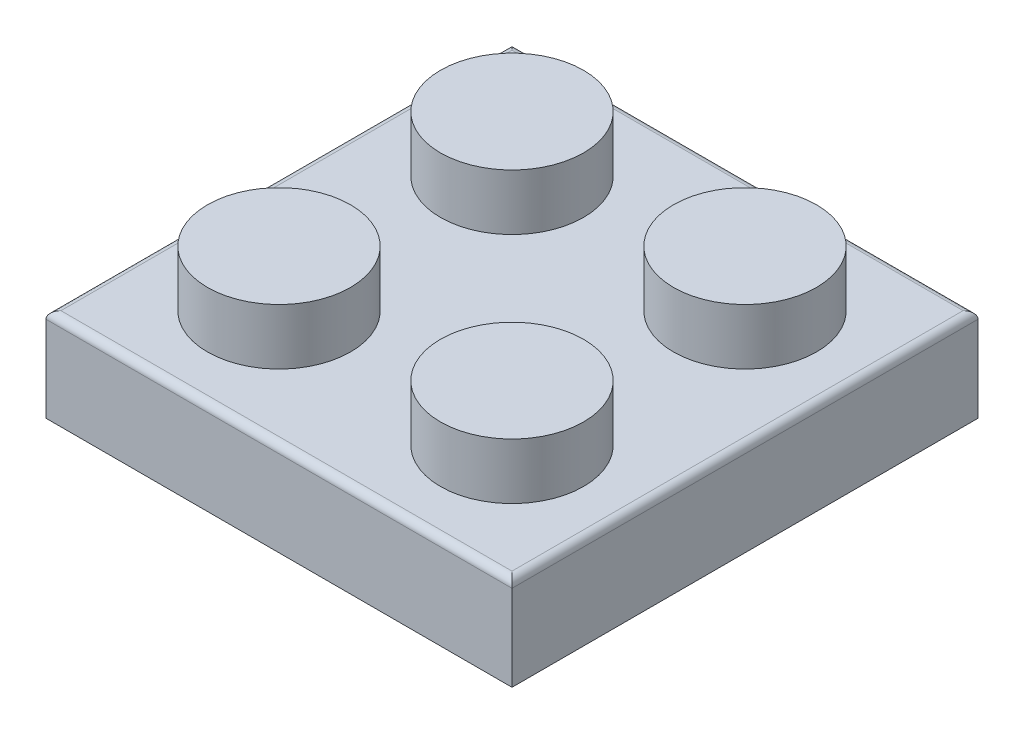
ISO-10303-21;
HEADER;
FILE_DESCRIPTION(('STEP AP214'),'2;1');
FILE_NAME('part.step','',(''),(''),'','','');
FILE_SCHEMA(('AUTOMOTIVE_DESIGN { 1 0 10303 214 1 1 1 1 }'));
ENDSEC;
DATA;
#1=APPLICATION_CONTEXT('core data for automotive mechanical design processes');
#2=APPLICATION_PROTOCOL_DEFINITION('international standard','automotive_design',2000,#1);
#3=PRODUCT_CONTEXT('',#1,'mechanical');
#4=PRODUCT('Part','Part','',(#3));
#5=PRODUCT_RELATED_PRODUCT_CATEGORY('part','',(#4));
#6=PRODUCT_DEFINITION_FORMATION('','',#4);
#7=PRODUCT_DEFINITION_CONTEXT('part definition',#1,'design');
#8=PRODUCT_DEFINITION('design','',#6,#7);
#9=PRODUCT_DEFINITION_SHAPE('','',#8);
#10=(LENGTH_UNIT() NAMED_UNIT(*) SI_UNIT(.MILLI.,.METRE.));
#11=(NAMED_UNIT(*) PLANE_ANGLE_UNIT() SI_UNIT($,.RADIAN.));
#12=(NAMED_UNIT(*) SI_UNIT($,.STERADIAN.) SOLID_ANGLE_UNIT());
#13=UNCERTAINTY_MEASURE_WITH_UNIT(LENGTH_MEASURE(1.E-05),#10,'distance_accuracy_value','');
#14=(GEOMETRIC_REPRESENTATION_CONTEXT(3) GLOBAL_UNCERTAINTY_ASSIGNED_CONTEXT((#13)) GLOBAL_UNIT_ASSIGNED_CONTEXT((#10,
#11,#12)) REPRESENTATION_CONTEXT('',''));
#15=CARTESIAN_POINT('',(0.,0.,0.));
#16=DIRECTION('',(0.,0.,1.));
#17=DIRECTION('',(1.,0.,0.));
#18=AXIS2_PLACEMENT_3D('',#15,#16,#17);
#19=CARTESIAN_POINT('',(-7.9375,1.5875,7.9375));
#20=DIRECTION('',(0.,-1.,0.));
#21=DIRECTION('',(0.,0.,-1.));
#22=AXIS2_PLACEMENT_3D('',#19,#20,#21);
#23=PLANE('',#22);
#24=CARTESIAN_POINT('',(-3.96875,1.5875,3.96875));
#25=DIRECTION('',(0.,-1.,0.));
#26=DIRECTION('',(0.,0.,-1.));
#27=AXIS2_PLACEMENT_3D('',#24,#25,#26);
#28=CIRCLE('',#27,0.8509);
#29=CARTESIAN_POINT('',(-3.96875,1.5875,3.11785));
#30=VERTEX_POINT('',#29);
#31=EDGE_CURVE('E138',#30,#30,#28,.F.);
#32=ORIENTED_EDGE('',*,*,#31,.T.);
#33=EDGE_LOOP('',(#32));
#34=FACE_BOUND('',#33,.T.);
#35=DIRECTION('',(0.,0.,1.));
#36=VECTOR('',#35,1.);
#37=CARTESIAN_POINT('',(-6.35,1.5875,7.9375));
#38=LINE('',#37,#36);
#39=CARTESIAN_POINT('',(-6.35,1.5875,-6.35));
#40=VERTEX_POINT('',#39);
#41=CARTESIAN_POINT('',(-6.35,1.5875,6.35));
#42=VERTEX_POINT('',#41);
#43=EDGE_CURVE('E117',#40,#42,#38,.T.);
#44=ORIENTED_EDGE('',*,*,#43,.F.);
#45=DIRECTION('',(1.,0.,0.));
#46=VECTOR('',#45,1.);
#47=CARTESIAN_POINT('',(-7.9375,1.5875,-6.35));
#48=LINE('',#47,#46);
#49=CARTESIAN_POINT('',(6.35,1.5875,-6.35));
#50=VERTEX_POINT('',#49);
#51=EDGE_CURVE('E145',#40,#50,#48,.T.);
#52=ORIENTED_EDGE('',*,*,#51,.T.);
#53=DIRECTION('',(0.,0.,-1.));
#54=VECTOR('',#53,1.);
#55=CARTESIAN_POINT('',(6.35,1.5875,7.9375));
#56=LINE('',#55,#54);
#57=CARTESIAN_POINT('',(6.35,1.5875,6.35));
#58=VERTEX_POINT('',#57);
#59=EDGE_CURVE('E143',#58,#50,#56,.T.);
#60=ORIENTED_EDGE('',*,*,#59,.F.);
#61=DIRECTION('',(-1.,0.,0.));
#62=VECTOR('',#61,1.);
#63=CARTESIAN_POINT('',(-7.9375,1.5875,6.35));
#64=LINE('',#63,#62);
#65=EDGE_CURVE('E128',#58,#42,#64,.T.);
#66=ORIENTED_EDGE('',*,*,#65,.T.);
#67=EDGE_LOOP('',(#44,#52,#60,#66));
#68=FACE_BOUND('',#67,.T.);
#69=CARTESIAN_POINT('',(3.96875,1.5875,3.96875));
#70=DIRECTION('',(0.,-1.,0.));
#71=DIRECTION('',(0.,0.,-1.));
#72=AXIS2_PLACEMENT_3D('',#69,#70,#71);
#73=CIRCLE('',#72,0.8509);
#74=CARTESIAN_POINT('',(3.96875,1.5875,3.11785));
#75=VERTEX_POINT('',#74);
#76=EDGE_CURVE('E150',#75,#75,#73,.F.);
#77=ORIENTED_EDGE('',*,*,#76,.T.);
#78=EDGE_LOOP('',(#77));
#79=FACE_BOUND('',#78,.T.);
#80=CARTESIAN_POINT('',(-3.96875,1.5875,-3.96875));
#81=DIRECTION('',(0.,-1.,0.));
#82=DIRECTION('',(0.,0.,-1.));
#83=AXIS2_PLACEMENT_3D('',#80,#81,#82);
#84=CIRCLE('',#83,0.8509);
#85=CARTESIAN_POINT('',(-3.96875,1.5875,-4.81965));
#86=VERTEX_POINT('',#85);
#87=EDGE_CURVE('E153',#86,#86,#84,.F.);
#88=ORIENTED_EDGE('',*,*,#87,.T.);
#89=EDGE_LOOP('',(#88));
#90=FACE_BOUND('',#89,.T.);
#91=CARTESIAN_POINT('',(3.96875,1.5875,-3.96875));
#92=DIRECTION('',(0.,-1.,0.));
#93=DIRECTION('',(0.,0.,-1.));
#94=AXIS2_PLACEMENT_3D('',#91,#92,#93);
#95=CIRCLE('',#94,0.8509);
#96=CARTESIAN_POINT('',(3.96875,1.5875,-4.81965));
#97=VERTEX_POINT('',#96);
#98=EDGE_CURVE('E157',#97,#97,#95,.F.);
#99=ORIENTED_EDGE('',*,*,#98,.T.);
#100=EDGE_LOOP('',(#99));
#101=FACE_BOUND('',#100,.T.);
#102=CARTESIAN_POINT('',(0.,1.5875,0.));
#103=DIRECTION('',(0.,-1.,0.));
#104=DIRECTION('',(1.,0.,0.));
#105=AXIS2_PLACEMENT_3D('',#102,#103,#104);
#106=CIRCLE('',#105,3.2004);
#107=CARTESIAN_POINT('',(3.2004,1.5875,0.));
#108=VERTEX_POINT('',#107);
#109=EDGE_CURVE('E271',#108,#108,#106,.T.);
#110=ORIENTED_EDGE('',*,*,#109,.F.);
#111=EDGE_LOOP('',(#110));
#112=FACE_BOUND('',#111,.T.);
#113=ADVANCED_FACE('F42',(#34,#68,#79,#90,#101,#112),#23,.T.);
#114=CARTESIAN_POINT('',(-7.9375,0.,7.9375));
#115=DIRECTION('',(0.,-1.,0.));
#116=DIRECTION('',(0.,0.,-1.));
#117=AXIS2_PLACEMENT_3D('',#114,#115,#116);
#118=PLANE('',#117);
#119=DIRECTION('',(0.,0.,1.));
#120=VECTOR('',#119,1.);
#121=CARTESIAN_POINT('',(-7.9375,0.,-7.9375));
#122=LINE('',#121,#120);
#123=CARTESIAN_POINT('',(-7.9375,0.,-7.9375));
#124=VERTEX_POINT('',#123);
#125=CARTESIAN_POINT('',(-7.9375,0.,7.9375));
#126=VERTEX_POINT('',#125);
#127=EDGE_CURVE('E190',#124,#126,#122,.T.);
#128=ORIENTED_EDGE('',*,*,#127,.F.);
#129=DIRECTION('',(1.,0.,0.));
#130=VECTOR('',#129,1.);
#131=CARTESIAN_POINT('',(-7.9375,0.,-7.9375));
#132=LINE('',#131,#130);
#133=CARTESIAN_POINT('',(7.9375,0.,-7.9375));
#134=VERTEX_POINT('',#133);
#135=EDGE_CURVE('E199',#124,#134,#132,.T.);
#136=ORIENTED_EDGE('',*,*,#135,.T.);
#137=DIRECTION('',(0.,0.,-1.));
#138=VECTOR('',#137,1.);
#139=CARTESIAN_POINT('',(7.9375,0.,7.9375));
#140=LINE('',#139,#138);
#141=CARTESIAN_POINT('',(7.9375,0.,7.9375));
#142=VERTEX_POINT('',#141);
#143=EDGE_CURVE('E196',#142,#134,#140,.T.);
#144=ORIENTED_EDGE('',*,*,#143,.F.);
#145=DIRECTION('',(-1.,0.,0.));
#146=VECTOR('',#145,1.);
#147=CARTESIAN_POINT('',(7.9375,0.,7.9375));
#148=LINE('',#147,#146);
#149=EDGE_CURVE('E193',#142,#126,#148,.T.);
#150=ORIENTED_EDGE('',*,*,#149,.T.);
#151=EDGE_LOOP('',(#128,#136,#144,#150));
#152=FACE_BOUND('',#151,.T.);
#153=DIRECTION('',(1.,0.,0.));
#154=VECTOR('',#153,1.);
#155=CARTESIAN_POINT('',(-7.9375,0.,-6.35));
#156=LINE('',#155,#154);
#157=CARTESIAN_POINT('',(-6.35,0.,-6.35));
#158=VERTEX_POINT('',#157);
#159=CARTESIAN_POINT('',(6.35,0.,-6.35));
#160=VERTEX_POINT('',#159);
#161=EDGE_CURVE('E129',#158,#160,#156,.T.);
#162=ORIENTED_EDGE('',*,*,#161,.F.);
#163=DIRECTION('',(0.,0.,1.));
#164=VECTOR('',#163,1.);
#165=CARTESIAN_POINT('',(-6.35,0.,7.9375));
#166=LINE('',#165,#164);
#167=CARTESIAN_POINT('',(-6.35,0.,6.35));
#168=VERTEX_POINT('',#167);
#169=EDGE_CURVE('E168',#158,#168,#166,.T.);
#170=ORIENTED_EDGE('',*,*,#169,.T.);
#171=DIRECTION('',(-1.,0.,0.));
#172=VECTOR('',#171,1.);
#173=CARTESIAN_POINT('',(-7.9375,0.,6.35));
#174=LINE('',#173,#172);
#175=CARTESIAN_POINT('',(6.35,0.,6.35));
#176=VERTEX_POINT('',#175);
#177=EDGE_CURVE('E136',#176,#168,#174,.T.);
#178=ORIENTED_EDGE('',*,*,#177,.F.);
#179=DIRECTION('',(0.,0.,-1.));
#180=VECTOR('',#179,1.);
#181=CARTESIAN_POINT('',(6.35,0.,7.9375));
#182=LINE('',#181,#180);
#183=EDGE_CURVE('E181',#176,#160,#182,.T.);
#184=ORIENTED_EDGE('',*,*,#183,.T.);
#185=EDGE_LOOP('',(#162,#170,#178,#184));
#186=FACE_BOUND('',#185,.T.);
#187=ADVANCED_FACE('F297',(#152,#186),#118,.T.);
#188=CARTESIAN_POINT('',(-7.9375,3.175,7.9375));
#189=DIRECTION('',(0.,-1.,0.));
#190=DIRECTION('',(0.,0.,-1.));
#191=AXIS2_PLACEMENT_3D('',#188,#189,#190);
#192=PLANE('',#191);
#193=DIRECTION('',(0.,0.,-1.));
#194=VECTOR('',#193,1.);
#195=CARTESIAN_POINT('',(7.6835,3.175,7.9375));
#196=LINE('',#195,#194);
#197=CARTESIAN_POINT('',(7.6835,3.175,7.6835));
#198=VERTEX_POINT('',#197);
#199=CARTESIAN_POINT('',(7.6835,3.175,-7.6835));
#200=VERTEX_POINT('',#199);
#201=EDGE_CURVE('E238',#198,#200,#196,.T.);
#202=ORIENTED_EDGE('',*,*,#201,.T.);
#203=DIRECTION('',(1.,0.,0.));
#204=VECTOR('',#203,1.);
#205=CARTESIAN_POINT('',(-7.9375,3.175,-7.6835));
#206=LINE('',#205,#204);
#207=CARTESIAN_POINT('',(-7.6835,3.175,-7.6835));
#208=VERTEX_POINT('',#207);
#209=EDGE_CURVE('E240',#200,#208,#206,.F.);
#210=ORIENTED_EDGE('',*,*,#209,.T.);
#211=DIRECTION('',(0.,0.,1.));
#212=VECTOR('',#211,1.);
#213=CARTESIAN_POINT('',(-7.6835,3.175,7.9375));
#214=LINE('',#213,#212);
#215=CARTESIAN_POINT('',(-7.6835,3.175,7.6835));
#216=VERTEX_POINT('',#215);
#217=EDGE_CURVE('E234',#208,#216,#214,.T.);
#218=ORIENTED_EDGE('',*,*,#217,.T.);
#219=DIRECTION('',(-1.,0.,0.));
#220=VECTOR('',#219,1.);
#221=CARTESIAN_POINT('',(7.9375,3.175,7.6835));
#222=LINE('',#221,#220);
#223=EDGE_CURVE('E236',#216,#198,#222,.F.);
#224=ORIENTED_EDGE('',*,*,#223,.T.);
#225=EDGE_LOOP('',(#202,#210,#218,#224));
#226=FACE_BOUND('',#225,.T.);
#227=CARTESIAN_POINT('',(-3.96875,3.175,3.96875));
#228=DIRECTION('',(0.,-1.,0.));
#229=DIRECTION('',(0.,0.,-1.));
#230=AXIS2_PLACEMENT_3D('',#227,#228,#229);
#231=CIRCLE('',#230,2.4384);
#232=CARTESIAN_POINT('',(-3.96875,3.175,1.53035));
#233=VERTEX_POINT('',#232);
#234=EDGE_CURVE('E210',#233,#233,#231,.F.);
#235=ORIENTED_EDGE('',*,*,#234,.F.);
#236=EDGE_LOOP('',(#235));
#237=FACE_BOUND('',#236,.T.);
#238=CARTESIAN_POINT('',(3.96875,3.175,3.96875));
#239=DIRECTION('',(0.,-1.,0.));
#240=DIRECTION('',(0.,0.,-1.));
#241=AXIS2_PLACEMENT_3D('',#238,#239,#240);
#242=CIRCLE('',#241,2.4384);
#243=CARTESIAN_POINT('',(3.96875,3.175,1.53035));
#244=VERTEX_POINT('',#243);
#245=EDGE_CURVE('E213',#244,#244,#242,.F.);
#246=ORIENTED_EDGE('',*,*,#245,.F.);
#247=EDGE_LOOP('',(#246));
#248=FACE_BOUND('',#247,.T.);
#249=CARTESIAN_POINT('',(-3.96875,3.175,-3.96875));
#250=DIRECTION('',(0.,-1.,0.));
#251=DIRECTION('',(0.,0.,-1.));
#252=AXIS2_PLACEMENT_3D('',#249,#250,#251);
#253=CIRCLE('',#252,2.4384);
#254=CARTESIAN_POINT('',(-3.96875,3.175,-6.40715));
#255=VERTEX_POINT('',#254);
#256=EDGE_CURVE('E216',#255,#255,#253,.F.);
#257=ORIENTED_EDGE('',*,*,#256,.F.);
#258=EDGE_LOOP('',(#257));
#259=FACE_BOUND('',#258,.T.);
#260=CARTESIAN_POINT('',(3.96875,3.175,-3.96875));
#261=DIRECTION('',(0.,-1.,0.));
#262=DIRECTION('',(0.,0.,-1.));
#263=AXIS2_PLACEMENT_3D('',#260,#261,#262);
#264=CIRCLE('',#263,2.4384);
#265=CARTESIAN_POINT('',(3.96875,3.175,-6.40715));
#266=VERTEX_POINT('',#265);
#267=EDGE_CURVE('E222',#266,#266,#264,.F.);
#268=ORIENTED_EDGE('',*,*,#267,.F.);
#269=EDGE_LOOP('',(#268));
#270=FACE_BOUND('',#269,.T.);
#271=ADVANCED_FACE('F245',(#226,#237,#248,#259,#270),#192,.F.);
#272=CARTESIAN_POINT('',(-7.9375,3.175,-7.9375));
#273=DIRECTION('',(1.,0.,0.));
#274=DIRECTION('',(0.,0.,-1.));
#275=AXIS2_PLACEMENT_3D('',#272,#273,#274);
#276=PLANE('',#275);
#277=DIRECTION('',(0.,-1.,0.));
#278=VECTOR('',#277,1.);
#279=CARTESIAN_POINT('',(-7.9375,3.175,7.9375));
#280=LINE('',#279,#278);
#281=CARTESIAN_POINT('',(-7.9375,2.921,7.9375));
#282=VERTEX_POINT('',#281);
#283=EDGE_CURVE('E208',#282,#126,#280,.T.);
#284=ORIENTED_EDGE('',*,*,#283,.F.);
#285=DIRECTION('',(0.,0.,1.));
#286=VECTOR('',#285,1.);
#287=CARTESIAN_POINT('',(-7.9375,2.921,-7.9375));
#288=LINE('',#287,#286);
#289=CARTESIAN_POINT('',(-7.9375,2.921,-7.9375));
#290=VERTEX_POINT('',#289);
#291=EDGE_CURVE('E11',#282,#290,#288,.F.);
#292=ORIENTED_EDGE('',*,*,#291,.T.);
#293=DIRECTION('',(0.,-1.,0.));
#294=VECTOR('',#293,1.);
#295=CARTESIAN_POINT('',(-7.9375,3.175,-7.9375));
#296=LINE('',#295,#294);
#297=EDGE_CURVE('E202',#290,#124,#296,.T.);
#298=ORIENTED_EDGE('',*,*,#297,.T.);
#299=ORIENTED_EDGE('',*,*,#127,.T.);
#300=EDGE_LOOP('',(#284,#292,#298,#299));
#301=FACE_BOUND('',#300,.T.);
#302=ADVANCED_FACE('F554',(#301),#276,.F.);
#303=CARTESIAN_POINT('',(7.9375,3.175,7.9375));
#304=DIRECTION('',(0.,0.,1.));
#305=DIRECTION('',(1.,0.,0.));
#306=AXIS2_PLACEMENT_3D('',#303,#304,#305);
#307=PLANE('',#306);
#308=DIRECTION('',(0.,-1.,0.));
#309=VECTOR('',#308,1.);
#310=CARTESIAN_POINT('',(7.9375,3.175,7.9375));
#311=LINE('',#310,#309);
#312=CARTESIAN_POINT('',(7.9375,2.921,7.9375));
#313=VERTEX_POINT('',#312);
#314=EDGE_CURVE('E206',#313,#142,#311,.T.);
#315=ORIENTED_EDGE('',*,*,#314,.F.);
#316=DIRECTION('',(-1.,0.,0.));
#317=VECTOR('',#316,1.);
#318=CARTESIAN_POINT('',(-7.9375,2.921,7.9375));
#319=LINE('',#318,#317);
#320=EDGE_CURVE('E50',#313,#282,#319,.T.);
#321=ORIENTED_EDGE('',*,*,#320,.T.);
#322=ORIENTED_EDGE('',*,*,#283,.T.);
#323=ORIENTED_EDGE('',*,*,#149,.F.);
#324=EDGE_LOOP('',(#315,#321,#322,#323));
#325=FACE_BOUND('',#324,.T.);
#326=ADVANCED_FACE('F545',(#325),#307,.T.);
#327=CARTESIAN_POINT('',(7.9375,3.175,7.9375));
#328=DIRECTION('',(-1.,0.,0.));
#329=DIRECTION('',(0.,0.,1.));
#330=AXIS2_PLACEMENT_3D('',#327,#328,#329);
#331=PLANE('',#330);
#332=DIRECTION('',(0.,-1.,0.));
#333=VECTOR('',#332,1.);
#334=CARTESIAN_POINT('',(7.9375,3.175,-7.9375));
#335=LINE('',#334,#333);
#336=CARTESIAN_POINT('',(7.9375,2.921,-7.9375));
#337=VERTEX_POINT('',#336);
#338=EDGE_CURVE('E204',#337,#134,#335,.T.);
#339=ORIENTED_EDGE('',*,*,#338,.F.);
#340=DIRECTION('',(0.,0.,-1.));
#341=VECTOR('',#340,1.);
#342=CARTESIAN_POINT('',(7.9375,2.921,7.9375));
#343=LINE('',#342,#341);
#344=EDGE_CURVE('E64',#337,#313,#343,.F.);
#345=ORIENTED_EDGE('',*,*,#344,.T.);
#346=ORIENTED_EDGE('',*,*,#314,.T.);
#347=ORIENTED_EDGE('',*,*,#143,.T.);
#348=EDGE_LOOP('',(#339,#345,#346,#347));
#349=FACE_BOUND('',#348,.T.);
#350=ADVANCED_FACE('F536',(#349),#331,.F.);
#351=CARTESIAN_POINT('',(-7.9375,3.175,-7.9375));
#352=DIRECTION('',(0.,0.,-1.));
#353=DIRECTION('',(-1.,0.,0.));
#354=AXIS2_PLACEMENT_3D('',#351,#352,#353);
#355=PLANE('',#354);
#356=ORIENTED_EDGE('',*,*,#297,.F.);
#357=DIRECTION('',(1.,0.,0.));
#358=VECTOR('',#357,1.);
#359=CARTESIAN_POINT('',(7.9375,2.921,-7.9375));
#360=LINE('',#359,#358);
#361=EDGE_CURVE('E231',#290,#337,#360,.T.);
#362=ORIENTED_EDGE('',*,*,#361,.T.);
#363=ORIENTED_EDGE('',*,*,#338,.T.);
#364=ORIENTED_EDGE('',*,*,#135,.F.);
#365=EDGE_LOOP('',(#356,#362,#363,#364));
#366=FACE_BOUND('',#365,.T.);
#367=ADVANCED_FACE('F528',(#366),#355,.T.);
#368=CARTESIAN_POINT('',(-3.96875,5.08,3.96875));
#369=DIRECTION('',(0.,-1.,0.));
#370=DIRECTION('',(0.,0.,-1.));
#371=AXIS2_PLACEMENT_3D('',#368,#369,#370);
#372=CYLINDRICAL_SURFACE('',#371,2.4384);
#373=CARTESIAN_POINT('',(-3.96875,5.08,3.96875));
#374=DIRECTION('',(0.,1.,0.));
#375=DIRECTION('',(0.,0.,1.));
#376=AXIS2_PLACEMENT_3D('',#373,#374,#375);
#377=CIRCLE('',#376,2.4384);
#378=CARTESIAN_POINT('',(-3.96875,5.08,1.53035));
#379=VERTEX_POINT('',#378);
#380=EDGE_CURVE('E187',#379,#379,#377,.T.);
#381=CARTESIAN_POINT('',(-3.96875,5.08,1.53035));
#382=CARTESIAN_POINT('',(-3.96875,5.06015625,1.53035));
#383=CARTESIAN_POINT('',(-3.96875,5.0403125,1.53035));
#384=CARTESIAN_POINT('',(-3.96875,5.000625,1.53035));
#385=CARTESIAN_POINT('',(-3.96875,4.98078125,1.53035));
#386=CARTESIAN_POINT('',(-3.96875,4.94109375,1.53035));
#387=CARTESIAN_POINT('',(-3.96875,4.92125,1.53035));
#388=CARTESIAN_POINT('',(-3.96875,4.8815625,1.53035));
#389=CARTESIAN_POINT('',(-3.96875,4.86171875,1.53035));
#390=CARTESIAN_POINT('',(-3.96875,4.82203125,1.53035));
#391=CARTESIAN_POINT('',(-3.96875,4.8021875,1.53035));
#392=CARTESIAN_POINT('',(-3.96875,4.7625,1.53035));
#393=CARTESIAN_POINT('',(-3.96875,4.74265625,1.53035));
#394=CARTESIAN_POINT('',(-3.96875,4.70296875,1.53035));
#395=CARTESIAN_POINT('',(-3.96875,4.683125,1.53035));
#396=CARTESIAN_POINT('',(-3.96875,4.6434375,1.53035));
#397=CARTESIAN_POINT('',(-3.96875,4.62359375,1.53035));
#398=CARTESIAN_POINT('',(-3.96875,4.58390625,1.53035));
#399=CARTESIAN_POINT('',(-3.96875,4.5640625,1.53035));
#400=CARTESIAN_POINT('',(-3.96875,4.524375,1.53035));
#401=CARTESIAN_POINT('',(-3.96875,4.50453125,1.53035));
#402=CARTESIAN_POINT('',(-3.96875,4.46484375,1.53035));
#403=CARTESIAN_POINT('',(-3.96875,4.445,1.53035));
#404=CARTESIAN_POINT('',(-3.96875,4.4053125,1.53035));
#405=CARTESIAN_POINT('',(-3.96875,4.38546875,1.53035));
#406=CARTESIAN_POINT('',(-3.96875,4.34578125,1.53035));
#407=CARTESIAN_POINT('',(-3.96875,4.3259375,1.53035));
#408=CARTESIAN_POINT('',(-3.96875,4.28625,1.53035));
#409=CARTESIAN_POINT('',(-3.96875,4.26640625,1.53035));
#410=CARTESIAN_POINT('',(-3.96875,4.22671875,1.53035));
#411=CARTESIAN_POINT('',(-3.96875,4.206875,1.53035));
#412=CARTESIAN_POINT('',(-3.96875,4.1671875,1.53035));
#413=CARTESIAN_POINT('',(-3.96875,4.14734375,1.53035));
#414=CARTESIAN_POINT('',(-3.96875,4.10765625,1.53035));
#415=CARTESIAN_POINT('',(-3.96875,4.0878125,1.53035));
#416=CARTESIAN_POINT('',(-3.96875,4.048125,1.53035));
#417=CARTESIAN_POINT('',(-3.96875,4.02828125,1.53035));
#418=CARTESIAN_POINT('',(-3.96875,3.98859375,1.53035));
#419=CARTESIAN_POINT('',(-3.96875,3.96875,1.53035));
#420=CARTESIAN_POINT('',(-3.96875,3.9290625,1.53035));
#421=CARTESIAN_POINT('',(-3.96875,3.90921875,1.53035));
#422=CARTESIAN_POINT('',(-3.96875,3.86953125,1.53035));
#423=CARTESIAN_POINT('',(-3.96875,3.8496875,1.53035));
#424=CARTESIAN_POINT('',(-3.96875,3.81,1.53035));
#425=CARTESIAN_POINT('',(-3.96875,3.79015625,1.53035));
#426=CARTESIAN_POINT('',(-3.96875,3.75046875,1.53035));
#427=CARTESIAN_POINT('',(-3.96875,3.730625,1.53035));
#428=CARTESIAN_POINT('',(-3.96875,3.6909375,1.53035));
#429=CARTESIAN_POINT('',(-3.96875,3.67109375,1.53035));
#430=CARTESIAN_POINT('',(-3.96875,3.63140625,1.53035));
#431=CARTESIAN_POINT('',(-3.96875,3.6115625,1.53035));
#432=CARTESIAN_POINT('',(-3.96875,3.571875,1.53035));
#433=CARTESIAN_POINT('',(-3.96875,3.55203125,1.53035));
#434=CARTESIAN_POINT('',(-3.96875,3.51234375,1.53035));
#435=CARTESIAN_POINT('',(-3.96875,3.4925,1.53035));
#436=CARTESIAN_POINT('',(-3.96875,3.4528125,1.53035));
#437=CARTESIAN_POINT('',(-3.96875,3.43296875,1.53035));
#438=CARTESIAN_POINT('',(-3.96875,3.39328125,1.53035));
#439=CARTESIAN_POINT('',(-3.96875,3.3734375,1.53035));
#440=CARTESIAN_POINT('',(-3.96875,3.33375,1.53035));
#441=CARTESIAN_POINT('',(-3.96875,3.31390625,1.53035));
#442=CARTESIAN_POINT('',(-3.96875,3.27421875,1.53035));
#443=CARTESIAN_POINT('',(-3.96875,3.254375,1.53035));
#444=CARTESIAN_POINT('',(-3.96875,3.2146875,1.53035));
#445=CARTESIAN_POINT('',(-3.96875,3.19484375,1.53035));
#446=CARTESIAN_POINT('',(-3.96875,3.175,1.53035));
#447=B_SPLINE_CURVE_WITH_KNOTS('',3,(#381,#382,#383,#384,#385,#386,#387,#388,#389,#390,#391,
#392,#393,#394,#395,#396,#397,#398,#399,#400,#401,#402,#403,#404,#405,#406,#407,#408,#409,#410,
#411,#412,#413,#414,#415,#416,#417,#418,#419,#420,#421,#422,#423,#424,#425,#426,#427,#428,#429,
#430,#431,#432,#433,#434,#435,#436,#437,#438,#439,#440,#441,#442,#443,#444,#445,#446),
.UNSPECIFIED.,.F.,.F.,(4,2,2,2,2,2,2,2,2,2,2,2,2,2,2,2,2,2,2,2,2,2,2,2,2,2,2,2,2,2,2,2,4),(0.,
0.0595312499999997,0.119062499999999,0.178593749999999,0.238125,0.297656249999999,
0.357187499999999,0.41671875,0.476249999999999,0.535781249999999,0.595312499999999,
0.654843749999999,0.714374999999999,0.773906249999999,0.833437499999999,0.892968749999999,
0.952499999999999,1.01203125,1.0715625,1.13109375,1.190625,1.25015625,1.3096875,1.36921875,
1.42875,1.48828125,1.5478125,1.60734375,1.666875,1.72640625,1.7859375,1.84546875,1.905),.UNSPECIFIED.);
#448=EDGE_CURVE('BSEAM519',#379,#233,#447,.T.);
#449=ORIENTED_EDGE('',*,*,#380,.F.);
#450=ORIENTED_EDGE('',*,*,#234,.T.);
#451=ORIENTED_EDGE('',*,*,#448,.T.);
#452=ORIENTED_EDGE('',*,*,#448,.F.);
#453=EDGE_LOOP('',(#449,#451,#450,#452));
#454=FACE_BOUND('',#453,.T.);
#455=ADVANCED_FACE('F519',(#454),#372,.T.);
#456=CARTESIAN_POINT('',(-3.96875,5.08,3.96875));
#457=DIRECTION('',(0.,1.,0.));
#458=DIRECTION('',(0.,0.,1.));
#459=AXIS2_PLACEMENT_3D('',#456,#457,#458);
#460=PLANE('',#459);
#461=ORIENTED_EDGE('',*,*,#380,.T.);
#462=EDGE_LOOP('',(#461));
#463=FACE_BOUND('',#462,.T.);
#464=ADVANCED_FACE('F505',(#463),#460,.T.);
#465=CARTESIAN_POINT('',(3.96875,5.08,3.96875));
#466=DIRECTION('',(0.,-1.,0.));
#467=DIRECTION('',(0.,0.,-1.));
#468=AXIS2_PLACEMENT_3D('',#465,#466,#467);
#469=CYLINDRICAL_SURFACE('',#468,2.4384);
#470=CARTESIAN_POINT('',(3.96875,5.08,3.96875));
#471=DIRECTION('',(0.,1.,0.));
#472=DIRECTION('',(0.,0.,1.));
#473=AXIS2_PLACEMENT_3D('',#470,#471,#472);
#474=CIRCLE('',#473,2.4384);
#475=CARTESIAN_POINT('',(3.96875,5.08,1.53035));
#476=VERTEX_POINT('',#475);
#477=EDGE_CURVE('E177',#476,#476,#474,.T.);
#478=CARTESIAN_POINT('',(3.96875,5.08,1.53035));
#479=CARTESIAN_POINT('',(3.96875,5.06015625,1.53035));
#480=CARTESIAN_POINT('',(3.96875,5.0403125,1.53035));
#481=CARTESIAN_POINT('',(3.96875,5.000625,1.53035));
#482=CARTESIAN_POINT('',(3.96875,4.98078125,1.53035));
#483=CARTESIAN_POINT('',(3.96875,4.94109375,1.53035));
#484=CARTESIAN_POINT('',(3.96875,4.92125,1.53035));
#485=CARTESIAN_POINT('',(3.96875,4.8815625,1.53035));
#486=CARTESIAN_POINT('',(3.96875,4.86171875,1.53035));
#487=CARTESIAN_POINT('',(3.96875,4.82203125,1.53035));
#488=CARTESIAN_POINT('',(3.96875,4.8021875,1.53035));
#489=CARTESIAN_POINT('',(3.96875,4.7625,1.53035));
#490=CARTESIAN_POINT('',(3.96875,4.74265625,1.53035));
#491=CARTESIAN_POINT('',(3.96875,4.70296875,1.53035));
#492=CARTESIAN_POINT('',(3.96875,4.683125,1.53035));
#493=CARTESIAN_POINT('',(3.96875,4.6434375,1.53035));
#494=CARTESIAN_POINT('',(3.96875,4.62359375,1.53035));
#495=CARTESIAN_POINT('',(3.96875,4.58390625,1.53035));
#496=CARTESIAN_POINT('',(3.96875,4.5640625,1.53035));
#497=CARTESIAN_POINT('',(3.96875,4.524375,1.53035));
#498=CARTESIAN_POINT('',(3.96875,4.50453125,1.53035));
#499=CARTESIAN_POINT('',(3.96875,4.46484375,1.53035));
#500=CARTESIAN_POINT('',(3.96875,4.445,1.53035));
#501=CARTESIAN_POINT('',(3.96875,4.4053125,1.53035));
#502=CARTESIAN_POINT('',(3.96875,4.38546875,1.53035));
#503=CARTESIAN_POINT('',(3.96875,4.34578125,1.53035));
#504=CARTESIAN_POINT('',(3.96875,4.3259375,1.53035));
#505=CARTESIAN_POINT('',(3.96875,4.28625,1.53035));
#506=CARTESIAN_POINT('',(3.96875,4.26640625,1.53035));
#507=CARTESIAN_POINT('',(3.96875,4.22671875,1.53035));
#508=CARTESIAN_POINT('',(3.96875,4.206875,1.53035));
#509=CARTESIAN_POINT('',(3.96875,4.1671875,1.53035));
#510=CARTESIAN_POINT('',(3.96875,4.14734375,1.53035));
#511=CARTESIAN_POINT('',(3.96875,4.10765625,1.53035));
#512=CARTESIAN_POINT('',(3.96875,4.0878125,1.53035));
#513=CARTESIAN_POINT('',(3.96875,4.048125,1.53035));
#514=CARTESIAN_POINT('',(3.96875,4.02828125,1.53035));
#515=CARTESIAN_POINT('',(3.96875,3.98859375,1.53035));
#516=CARTESIAN_POINT('',(3.96875,3.96875,1.53035));
#517=CARTESIAN_POINT('',(3.96875,3.9290625,1.53035));
#518=CARTESIAN_POINT('',(3.96875,3.90921875,1.53035));
#519=CARTESIAN_POINT('',(3.96875,3.86953125,1.53035));
#520=CARTESIAN_POINT('',(3.96875,3.8496875,1.53035));
#521=CARTESIAN_POINT('',(3.96875,3.81,1.53035));
#522=CARTESIAN_POINT('',(3.96875,3.79015625,1.53035));
#523=CARTESIAN_POINT('',(3.96875,3.75046875,1.53035));
#524=CARTESIAN_POINT('',(3.96875,3.730625,1.53035));
#525=CARTESIAN_POINT('',(3.96875,3.6909375,1.53035));
#526=CARTESIAN_POINT('',(3.96875,3.67109375,1.53035));
#527=CARTESIAN_POINT('',(3.96875,3.63140625,1.53035));
#528=CARTESIAN_POINT('',(3.96875,3.6115625,1.53035));
#529=CARTESIAN_POINT('',(3.96875,3.571875,1.53035));
#530=CARTESIAN_POINT('',(3.96875,3.55203125,1.53035));
#531=CARTESIAN_POINT('',(3.96875,3.51234375,1.53035));
#532=CARTESIAN_POINT('',(3.96875,3.4925,1.53035));
#533=CARTESIAN_POINT('',(3.96875,3.4528125,1.53035));
#534=CARTESIAN_POINT('',(3.96875,3.43296875,1.53035));
#535=CARTESIAN_POINT('',(3.96875,3.39328125,1.53035));
#536=CARTESIAN_POINT('',(3.96875,3.3734375,1.53035));
#537=CARTESIAN_POINT('',(3.96875,3.33375,1.53035));
#538=CARTESIAN_POINT('',(3.96875,3.31390625,1.53035));
#539=CARTESIAN_POINT('',(3.96875,3.27421875,1.53035));
#540=CARTESIAN_POINT('',(3.96875,3.254375,1.53035));
#541=CARTESIAN_POINT('',(3.96875,3.2146875,1.53035));
#542=CARTESIAN_POINT('',(3.96875,3.19484375,1.53035));
#543=CARTESIAN_POINT('',(3.96875,3.175,1.53035));
#544=B_SPLINE_CURVE_WITH_KNOTS('',3,(#478,#479,#480,#481,#482,#483,#484,#485,#486,#487,#488,
#489,#490,#491,#492,#493,#494,#495,#496,#497,#498,#499,#500,#501,#502,#503,#504,#505,#506,#507,
#508,#509,#510,#511,#512,#513,#514,#515,#516,#517,#518,#519,#520,#521,#522,#523,#524,#525,#526,
#527,#528,#529,#530,#531,#532,#533,#534,#535,#536,#537,#538,#539,#540,#541,#542,#543),
.UNSPECIFIED.,.F.,.F.,(4,2,2,2,2,2,2,2,2,2,2,2,2,2,2,2,2,2,2,2,2,2,2,2,2,2,2,2,2,2,2,2,4),(0.,
0.0595312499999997,0.119062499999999,0.178593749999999,0.238125,0.297656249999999,
0.357187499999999,0.41671875,0.476249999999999,0.535781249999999,0.595312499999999,
0.654843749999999,0.714374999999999,0.773906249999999,0.833437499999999,0.892968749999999,
0.952499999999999,1.01203125,1.0715625,1.13109375,1.190625,1.25015625,1.3096875,1.36921875,
1.42875,1.48828125,1.5478125,1.60734375,1.666875,1.72640625,1.7859375,1.84546875,1.905),.UNSPECIFIED.);
#545=EDGE_CURVE('BSEAM496',#476,#244,#544,.T.);
#546=ORIENTED_EDGE('',*,*,#477,.F.);
#547=ORIENTED_EDGE('',*,*,#245,.T.);
#548=ORIENTED_EDGE('',*,*,#545,.T.);
#549=ORIENTED_EDGE('',*,*,#545,.F.);
#550=EDGE_LOOP('',(#546,#548,#547,#549));
#551=FACE_BOUND('',#550,.T.);
#552=ADVANCED_FACE('F496',(#551),#469,.T.);
#553=CARTESIAN_POINT('',(3.96875,5.08,3.96875));
#554=DIRECTION('',(0.,1.,0.));
#555=DIRECTION('',(0.,0.,1.));
#556=AXIS2_PLACEMENT_3D('',#553,#554,#555);
#557=PLANE('',#556);
#558=ORIENTED_EDGE('',*,*,#477,.T.);
#559=EDGE_LOOP('',(#558));
#560=FACE_BOUND('',#559,.T.);
#561=ADVANCED_FACE('F493',(#560),#557,.T.);
#562=CARTESIAN_POINT('',(-3.96875,5.08,-3.96875));
#563=DIRECTION('',(0.,1.,0.));
#564=DIRECTION('',(0.,0.,1.));
#565=AXIS2_PLACEMENT_3D('',#562,#563,#564);
#566=PLANE('',#565);
#567=CARTESIAN_POINT('',(-3.96875,5.08,-3.96875));
#568=DIRECTION('',(0.,1.,0.));
#569=DIRECTION('',(0.,0.,1.));
#570=AXIS2_PLACEMENT_3D('',#567,#568,#569);
#571=CIRCLE('',#570,2.4384);
#572=CARTESIAN_POINT('',(-3.96875,5.08,-6.40715));
#573=VERTEX_POINT('',#572);
#574=EDGE_CURVE('E219',#573,#573,#571,.T.);
#575=ORIENTED_EDGE('',*,*,#574,.T.);
#576=EDGE_LOOP('',(#575));
#577=FACE_BOUND('',#576,.T.);
#578=ADVANCED_FACE('F483',(#577),#566,.T.);
#579=CARTESIAN_POINT('',(-3.96875,5.08,-3.96875));
#580=DIRECTION('',(0.,-1.,0.));
#581=DIRECTION('',(0.,0.,-1.));
#582=AXIS2_PLACEMENT_3D('',#579,#580,#581);
#583=CYLINDRICAL_SURFACE('',#582,2.4384);
#584=CARTESIAN_POINT('',(-3.96875,5.08,-6.40715));
#585=CARTESIAN_POINT('',(-3.96875,5.06015625,-6.40715));
#586=CARTESIAN_POINT('',(-3.96875,5.0403125,-6.40715));
#587=CARTESIAN_POINT('',(-3.96875,5.000625,-6.40715));
#588=CARTESIAN_POINT('',(-3.96875,4.98078125,-6.40715));
#589=CARTESIAN_POINT('',(-3.96875,4.94109375,-6.40715));
#590=CARTESIAN_POINT('',(-3.96875,4.92125,-6.40715));
#591=CARTESIAN_POINT('',(-3.96875,4.8815625,-6.40715));
#592=CARTESIAN_POINT('',(-3.96875,4.86171875,-6.40715));
#593=CARTESIAN_POINT('',(-3.96875,4.82203125,-6.40715));
#594=CARTESIAN_POINT('',(-3.96875,4.8021875,-6.40715));
#595=CARTESIAN_POINT('',(-3.96875,4.7625,-6.40715));
#596=CARTESIAN_POINT('',(-3.96875,4.74265625,-6.40715));
#597=CARTESIAN_POINT('',(-3.96875,4.70296875,-6.40715));
#598=CARTESIAN_POINT('',(-3.96875,4.683125,-6.40715));
#599=CARTESIAN_POINT('',(-3.96875,4.6434375,-6.40715));
#600=CARTESIAN_POINT('',(-3.96875,4.62359375,-6.40715));
#601=CARTESIAN_POINT('',(-3.96875,4.58390625,-6.40715));
#602=CARTESIAN_POINT('',(-3.96875,4.5640625,-6.40715));
#603=CARTESIAN_POINT('',(-3.96875,4.524375,-6.40715));
#604=CARTESIAN_POINT('',(-3.96875,4.50453125,-6.40715));
#605=CARTESIAN_POINT('',(-3.96875,4.46484375,-6.40715));
#606=CARTESIAN_POINT('',(-3.96875,4.445,-6.40715));
#607=CARTESIAN_POINT('',(-3.96875,4.4053125,-6.40715));
#608=CARTESIAN_POINT('',(-3.96875,4.38546875,-6.40715));
#609=CARTESIAN_POINT('',(-3.96875,4.34578125,-6.40715));
#610=CARTESIAN_POINT('',(-3.96875,4.3259375,-6.40715));
#611=CARTESIAN_POINT('',(-3.96875,4.28625,-6.40715));
#612=CARTESIAN_POINT('',(-3.96875,4.26640625,-6.40715));
#613=CARTESIAN_POINT('',(-3.96875,4.22671875,-6.40715));
#614=CARTESIAN_POINT('',(-3.96875,4.206875,-6.40715));
#615=CARTESIAN_POINT('',(-3.96875,4.1671875,-6.40715));
#616=CARTESIAN_POINT('',(-3.96875,4.14734375,-6.40715));
#617=CARTESIAN_POINT('',(-3.96875,4.10765625,-6.40715));
#618=CARTESIAN_POINT('',(-3.96875,4.0878125,-6.40715));
#619=CARTESIAN_POINT('',(-3.96875,4.048125,-6.40715));
#620=CARTESIAN_POINT('',(-3.96875,4.02828125,-6.40715));
#621=CARTESIAN_POINT('',(-3.96875,3.98859375,-6.40715));
#622=CARTESIAN_POINT('',(-3.96875,3.96875,-6.40715));
#623=CARTESIAN_POINT('',(-3.96875,3.9290625,-6.40715));
#624=CARTESIAN_POINT('',(-3.96875,3.90921875,-6.40715));
#625=CARTESIAN_POINT('',(-3.96875,3.86953125,-6.40715));
#626=CARTESIAN_POINT('',(-3.96875,3.8496875,-6.40715));
#627=CARTESIAN_POINT('',(-3.96875,3.81,-6.40715));
#628=CARTESIAN_POINT('',(-3.96875,3.79015625,-6.40715));
#629=CARTESIAN_POINT('',(-3.96875,3.75046875,-6.40715));
#630=CARTESIAN_POINT('',(-3.96875,3.730625,-6.40715));
#631=CARTESIAN_POINT('',(-3.96875,3.6909375,-6.40715));
#632=CARTESIAN_POINT('',(-3.96875,3.67109375,-6.40715));
#633=CARTESIAN_POINT('',(-3.96875,3.63140625,-6.40715));
#634=CARTESIAN_POINT('',(-3.96875,3.6115625,-6.40715));
#635=CARTESIAN_POINT('',(-3.96875,3.571875,-6.40715));
#636=CARTESIAN_POINT('',(-3.96875,3.55203125,-6.40715));
#637=CARTESIAN_POINT('',(-3.96875,3.51234375,-6.40715));
#638=CARTESIAN_POINT('',(-3.96875,3.4925,-6.40715));
#639=CARTESIAN_POINT('',(-3.96875,3.4528125,-6.40715));
#640=CARTESIAN_POINT('',(-3.96875,3.43296875,-6.40715));
#641=CARTESIAN_POINT('',(-3.96875,3.39328125,-6.40715));
#642=CARTESIAN_POINT('',(-3.96875,3.3734375,-6.40715));
#643=CARTESIAN_POINT('',(-3.96875,3.33375,-6.40715));
#644=CARTESIAN_POINT('',(-3.96875,3.31390625,-6.40715));
#645=CARTESIAN_POINT('',(-3.96875,3.27421875,-6.40715));
#646=CARTESIAN_POINT('',(-3.96875,3.254375,-6.40715));
#647=CARTESIAN_POINT('',(-3.96875,3.2146875,-6.40715));
#648=CARTESIAN_POINT('',(-3.96875,3.19484375,-6.40715));
#649=CARTESIAN_POINT('',(-3.96875,3.175,-6.40715));
#650=B_SPLINE_CURVE_WITH_KNOTS('',3,(#584,#585,#586,#587,#588,#589,#590,#591,#592,#593,#594,
#595,#596,#597,#598,#599,#600,#601,#602,#603,#604,#605,#606,#607,#608,#609,#610,#611,#612,#613,
#614,#615,#616,#617,#618,#619,#620,#621,#622,#623,#624,#625,#626,#627,#628,#629,#630,#631,#632,
#633,#634,#635,#636,#637,#638,#639,#640,#641,#642,#643,#644,#645,#646,#647,#648,#649),
.UNSPECIFIED.,.F.,.F.,(4,2,2,2,2,2,2,2,2,2,2,2,2,2,2,2,2,2,2,2,2,2,2,2,2,2,2,2,2,2,2,2,4),(0.,
0.0595312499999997,0.119062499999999,0.178593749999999,0.238125,0.297656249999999,
0.357187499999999,0.41671875,0.476249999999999,0.535781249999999,0.595312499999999,
0.654843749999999,0.714374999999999,0.773906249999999,0.833437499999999,0.892968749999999,
0.952499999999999,1.01203125,1.0715625,1.13109375,1.190625,1.25015625,1.3096875,1.36921875,
1.42875,1.48828125,1.5478125,1.60734375,1.666875,1.72640625,1.7859375,1.84546875,1.905),.UNSPECIFIED.);
#651=EDGE_CURVE('BSEAM474',#573,#255,#650,.T.);
#652=ORIENTED_EDGE('',*,*,#574,.F.);
#653=ORIENTED_EDGE('',*,*,#256,.T.);
#654=ORIENTED_EDGE('',*,*,#651,.T.);
#655=ORIENTED_EDGE('',*,*,#651,.F.);
#656=EDGE_LOOP('',(#652,#654,#653,#655));
#657=FACE_BOUND('',#656,.T.);
#658=ADVANCED_FACE('F474',(#657),#583,.T.);
#659=CARTESIAN_POINT('',(3.96875,5.08,-3.96875));
#660=DIRECTION('',(0.,1.,0.));
#661=DIRECTION('',(0.,0.,1.));
#662=AXIS2_PLACEMENT_3D('',#659,#660,#661);
#663=PLANE('',#662);
#664=CARTESIAN_POINT('',(3.96875,5.08,-3.96875));
#665=DIRECTION('',(0.,1.,0.));
#666=DIRECTION('',(0.,0.,1.));
#667=AXIS2_PLACEMENT_3D('',#664,#665,#666);
#668=CIRCLE('',#667,2.4384);
#669=CARTESIAN_POINT('',(3.96875,5.08,-6.40715));
#670=VERTEX_POINT('',#669);
#671=EDGE_CURVE('E225',#670,#670,#668,.T.);
#672=ORIENTED_EDGE('',*,*,#671,.T.);
#673=EDGE_LOOP('',(#672));
#674=FACE_BOUND('',#673,.T.);
#675=ADVANCED_FACE('F44',(#674),#663,.T.);
#676=CARTESIAN_POINT('',(3.96875,5.08,-3.96875));
#677=DIRECTION('',(0.,-1.,0.));
#678=DIRECTION('',(0.,0.,-1.));
#679=AXIS2_PLACEMENT_3D('',#676,#677,#678);
#680=CYLINDRICAL_SURFACE('',#679,2.4384);
#681=CARTESIAN_POINT('',(3.96875,5.08,-6.40715));
#682=CARTESIAN_POINT('',(3.96875,5.06015625,-6.40715));
#683=CARTESIAN_POINT('',(3.96875,5.0403125,-6.40715));
#684=CARTESIAN_POINT('',(3.96875,5.000625,-6.40715));
#685=CARTESIAN_POINT('',(3.96875,4.98078125,-6.40715));
#686=CARTESIAN_POINT('',(3.96875,4.94109375,-6.40715));
#687=CARTESIAN_POINT('',(3.96875,4.92125,-6.40715));
#688=CARTESIAN_POINT('',(3.96875,4.8815625,-6.40715));
#689=CARTESIAN_POINT('',(3.96875,4.86171875,-6.40715));
#690=CARTESIAN_POINT('',(3.96875,4.82203125,-6.40715));
#691=CARTESIAN_POINT('',(3.96875,4.8021875,-6.40715));
#692=CARTESIAN_POINT('',(3.96875,4.7625,-6.40715));
#693=CARTESIAN_POINT('',(3.96875,4.74265625,-6.40715));
#694=CARTESIAN_POINT('',(3.96875,4.70296875,-6.40715));
#695=CARTESIAN_POINT('',(3.96875,4.683125,-6.40715));
#696=CARTESIAN_POINT('',(3.96875,4.6434375,-6.40715));
#697=CARTESIAN_POINT('',(3.96875,4.62359375,-6.40715));
#698=CARTESIAN_POINT('',(3.96875,4.58390625,-6.40715));
#699=CARTESIAN_POINT('',(3.96875,4.5640625,-6.40715));
#700=CARTESIAN_POINT('',(3.96875,4.524375,-6.40715));
#701=CARTESIAN_POINT('',(3.96875,4.50453125,-6.40715));
#702=CARTESIAN_POINT('',(3.96875,4.46484375,-6.40715));
#703=CARTESIAN_POINT('',(3.96875,4.445,-6.40715));
#704=CARTESIAN_POINT('',(3.96875,4.4053125,-6.40715));
#705=CARTESIAN_POINT('',(3.96875,4.38546875,-6.40715));
#706=CARTESIAN_POINT('',(3.96875,4.34578125,-6.40715));
#707=CARTESIAN_POINT('',(3.96875,4.3259375,-6.40715));
#708=CARTESIAN_POINT('',(3.96875,4.28625,-6.40715));
#709=CARTESIAN_POINT('',(3.96875,4.26640625,-6.40715));
#710=CARTESIAN_POINT('',(3.96875,4.22671875,-6.40715));
#711=CARTESIAN_POINT('',(3.96875,4.206875,-6.40715));
#712=CARTESIAN_POINT('',(3.96875,4.1671875,-6.40715));
#713=CARTESIAN_POINT('',(3.96875,4.14734375,-6.40715));
#714=CARTESIAN_POINT('',(3.96875,4.10765625,-6.40715));
#715=CARTESIAN_POINT('',(3.96875,4.0878125,-6.40715));
#716=CARTESIAN_POINT('',(3.96875,4.048125,-6.40715));
#717=CARTESIAN_POINT('',(3.96875,4.02828125,-6.40715));
#718=CARTESIAN_POINT('',(3.96875,3.98859375,-6.40715));
#719=CARTESIAN_POINT('',(3.96875,3.96875,-6.40715));
#720=CARTESIAN_POINT('',(3.96875,3.9290625,-6.40715));
#721=CARTESIAN_POINT('',(3.96875,3.90921875,-6.40715));
#722=CARTESIAN_POINT('',(3.96875,3.86953125,-6.40715));
#723=CARTESIAN_POINT('',(3.96875,3.8496875,-6.40715));
#724=CARTESIAN_POINT('',(3.96875,3.81,-6.40715));
#725=CARTESIAN_POINT('',(3.96875,3.79015625,-6.40715));
#726=CARTESIAN_POINT('',(3.96875,3.75046875,-6.40715));
#727=CARTESIAN_POINT('',(3.96875,3.730625,-6.40715));
#728=CARTESIAN_POINT('',(3.96875,3.6909375,-6.40715));
#729=CARTESIAN_POINT('',(3.96875,3.67109375,-6.40715));
#730=CARTESIAN_POINT('',(3.96875,3.63140625,-6.40715));
#731=CARTESIAN_POINT('',(3.96875,3.6115625,-6.40715));
#732=CARTESIAN_POINT('',(3.96875,3.571875,-6.40715));
#733=CARTESIAN_POINT('',(3.96875,3.55203125,-6.40715));
#734=CARTESIAN_POINT('',(3.96875,3.51234375,-6.40715));
#735=CARTESIAN_POINT('',(3.96875,3.4925,-6.40715));
#736=CARTESIAN_POINT('',(3.96875,3.4528125,-6.40715));
#737=CARTESIAN_POINT('',(3.96875,3.43296875,-6.40715));
#738=CARTESIAN_POINT('',(3.96875,3.39328125,-6.40715));
#739=CARTESIAN_POINT('',(3.96875,3.3734375,-6.40715));
#740=CARTESIAN_POINT('',(3.96875,3.33375,-6.40715));
#741=CARTESIAN_POINT('',(3.96875,3.31390625,-6.40715));
#742=CARTESIAN_POINT('',(3.96875,3.27421875,-6.40715));
#743=CARTESIAN_POINT('',(3.96875,3.254375,-6.40715));
#744=CARTESIAN_POINT('',(3.96875,3.2146875,-6.40715));
#745=CARTESIAN_POINT('',(3.96875,3.19484375,-6.40715));
#746=CARTESIAN_POINT('',(3.96875,3.175,-6.40715));
#747=B_SPLINE_CURVE_WITH_KNOTS('',3,(#681,#682,#683,#684,#685,#686,#687,#688,#689,#690,#691,
#692,#693,#694,#695,#696,#697,#698,#699,#700,#701,#702,#703,#704,#705,#706,#707,#708,#709,#710,
#711,#712,#713,#714,#715,#716,#717,#718,#719,#720,#721,#722,#723,#724,#725,#726,#727,#728,#729,
#730,#731,#732,#733,#734,#735,#736,#737,#738,#739,#740,#741,#742,#743,#744,#745,#746),
.UNSPECIFIED.,.F.,.F.,(4,2,2,2,2,2,2,2,2,2,2,2,2,2,2,2,2,2,2,2,2,2,2,2,2,2,2,2,2,2,2,2,4),(0.,
0.0595312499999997,0.119062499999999,0.178593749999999,0.238125,0.297656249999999,
0.357187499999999,0.41671875,0.476249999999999,0.535781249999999,0.595312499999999,
0.654843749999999,0.714374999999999,0.773906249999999,0.833437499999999,0.892968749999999,
0.952499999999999,1.01203125,1.0715625,1.13109375,1.190625,1.25015625,1.3096875,1.36921875,
1.42875,1.48828125,1.5478125,1.60734375,1.666875,1.72640625,1.7859375,1.84546875,1.905),.UNSPECIFIED.);
#748=EDGE_CURVE('BSEAM459',#670,#266,#747,.T.);
#749=ORIENTED_EDGE('',*,*,#671,.F.);
#750=ORIENTED_EDGE('',*,*,#267,.T.);
#751=ORIENTED_EDGE('',*,*,#748,.T.);
#752=ORIENTED_EDGE('',*,*,#748,.F.);
#753=EDGE_LOOP('',(#749,#751,#750,#752));
#754=FACE_BOUND('',#753,.T.);
#755=ADVANCED_FACE('F459',(#754),#680,.T.);
#756=CARTESIAN_POINT('',(-6.35,3.175,-7.9375));
#757=DIRECTION('',(1.,0.,0.));
#758=DIRECTION('',(0.,0.,-1.));
#759=AXIS2_PLACEMENT_3D('',#756,#757,#758);
#760=PLANE('',#759);
#761=ORIENTED_EDGE('',*,*,#169,.F.);
#762=DIRECTION('',(0.,-1.,0.));
#763=VECTOR('',#762,1.);
#764=CARTESIAN_POINT('',(-6.35,3.175,-6.35));
#765=LINE('',#764,#763);
#766=EDGE_CURVE('E123',#40,#158,#765,.T.);
#767=ORIENTED_EDGE('',*,*,#766,.F.);
#768=ORIENTED_EDGE('',*,*,#43,.T.);
#769=DIRECTION('',(0.,-1.,0.));
#770=VECTOR('',#769,1.);
#771=CARTESIAN_POINT('',(-6.35,3.175,6.35));
#772=LINE('',#771,#770);
#773=EDGE_CURVE('E121',#42,#168,#772,.T.);
#774=ORIENTED_EDGE('',*,*,#773,.T.);
#775=EDGE_LOOP('',(#761,#767,#768,#774));
#776=FACE_BOUND('',#775,.T.);
#777=ADVANCED_FACE('F120',(#776),#760,.T.);
#778=CARTESIAN_POINT('',(7.9375,3.175,6.35));
#779=DIRECTION('',(0.,0.,1.));
#780=DIRECTION('',(1.,0.,0.));
#781=AXIS2_PLACEMENT_3D('',#778,#779,#780);
#782=PLANE('',#781);
#783=ORIENTED_EDGE('',*,*,#177,.T.);
#784=ORIENTED_EDGE('',*,*,#773,.F.);
#785=ORIENTED_EDGE('',*,*,#65,.F.);
#786=DIRECTION('',(0.,-1.,0.));
#787=VECTOR('',#786,1.);
#788=CARTESIAN_POINT('',(6.35,3.175,6.35));
#789=LINE('',#788,#787);
#790=EDGE_CURVE('E139',#58,#176,#789,.T.);
#791=ORIENTED_EDGE('',*,*,#790,.T.);
#792=EDGE_LOOP('',(#783,#784,#785,#791));
#793=FACE_BOUND('',#792,.T.);
#794=ADVANCED_FACE('F133',(#793),#782,.F.);
#795=CARTESIAN_POINT('',(6.35,3.175,7.9375));
#796=DIRECTION('',(-1.,0.,0.));
#797=DIRECTION('',(0.,0.,1.));
#798=AXIS2_PLACEMENT_3D('',#795,#796,#797);
#799=PLANE('',#798);
#800=ORIENTED_EDGE('',*,*,#183,.F.);
#801=ORIENTED_EDGE('',*,*,#790,.F.);
#802=ORIENTED_EDGE('',*,*,#59,.T.);
#803=DIRECTION('',(0.,-1.,0.));
#804=VECTOR('',#803,1.);
#805=CARTESIAN_POINT('',(6.35,3.175,-6.35));
#806=LINE('',#805,#804);
#807=EDGE_CURVE('E162',#50,#160,#806,.T.);
#808=ORIENTED_EDGE('',*,*,#807,.T.);
#809=EDGE_LOOP('',(#800,#801,#802,#808));
#810=FACE_BOUND('',#809,.T.);
#811=ADVANCED_FACE('F293',(#810),#799,.T.);
#812=CARTESIAN_POINT('',(-7.9375,3.175,-6.35));
#813=DIRECTION('',(0.,0.,-1.));
#814=DIRECTION('',(-1.,0.,0.));
#815=AXIS2_PLACEMENT_3D('',#812,#813,#814);
#816=PLANE('',#815);
#817=ORIENTED_EDGE('',*,*,#161,.T.);
#818=ORIENTED_EDGE('',*,*,#807,.F.);
#819=ORIENTED_EDGE('',*,*,#51,.F.);
#820=ORIENTED_EDGE('',*,*,#766,.T.);
#821=EDGE_LOOP('',(#817,#818,#819,#820));
#822=FACE_BOUND('',#821,.T.);
#823=ADVANCED_FACE('F282',(#822),#816,.F.);
#824=CARTESIAN_POINT('',(-3.96875,5.08,3.96875));
#825=DIRECTION('',(0.,-1.,0.));
#826=DIRECTION('',(0.,0.,-1.));
#827=AXIS2_PLACEMENT_3D('',#824,#825,#826);
#828=CYLINDRICAL_SURFACE('',#827,0.8509);
#829=CARTESIAN_POINT('',(-3.96875,3.4925,3.96875));
#830=DIRECTION('',(0.,1.,0.));
#831=DIRECTION('',(0.,0.,1.));
#832=AXIS2_PLACEMENT_3D('',#829,#830,#831);
#833=CIRCLE('',#832,0.8509);
#834=CARTESIAN_POINT('',(-3.96875,3.4925,3.11785));
#835=VERTEX_POINT('',#834);
#836=EDGE_CURVE('E165',#835,#835,#833,.T.);
#837=CARTESIAN_POINT('',(-3.96875,3.4925,3.11785));
#838=CARTESIAN_POINT('',(-3.96875,3.47265625,3.11785));
#839=CARTESIAN_POINT('',(-3.96875,3.4528125,3.11785));
#840=CARTESIAN_POINT('',(-3.96875,3.413125,3.11785));
#841=CARTESIAN_POINT('',(-3.96875,3.39328125,3.11785));
#842=CARTESIAN_POINT('',(-3.96875,3.35359375,3.11785));
#843=CARTESIAN_POINT('',(-3.96875,3.33375,3.11785));
#844=CARTESIAN_POINT('',(-3.96875,3.2940625,3.11785));
#845=CARTESIAN_POINT('',(-3.96875,3.27421875,3.11785));
#846=CARTESIAN_POINT('',(-3.96875,3.23453125,3.11785));
#847=CARTESIAN_POINT('',(-3.96875,3.2146875,3.11785));
#848=CARTESIAN_POINT('',(-3.96875,3.175,3.11785));
#849=CARTESIAN_POINT('',(-3.96875,3.15515625,3.11785));
#850=CARTESIAN_POINT('',(-3.96875,3.11546875,3.11785));
#851=CARTESIAN_POINT('',(-3.96875,3.095625,3.11785));
#852=CARTESIAN_POINT('',(-3.96875,3.0559375,3.11785));
#853=CARTESIAN_POINT('',(-3.96875,3.03609375,3.11785));
#854=CARTESIAN_POINT('',(-3.96875,2.99640625,3.11785));
#855=CARTESIAN_POINT('',(-3.96875,2.9765625,3.11785));
#856=CARTESIAN_POINT('',(-3.96875,2.936875,3.11785));
#857=CARTESIAN_POINT('',(-3.96875,2.91703125,3.11785));
#858=CARTESIAN_POINT('',(-3.96875,2.87734375,3.11785));
#859=CARTESIAN_POINT('',(-3.96875,2.8575,3.11785));
#860=CARTESIAN_POINT('',(-3.96875,2.8178125,3.11785));
#861=CARTESIAN_POINT('',(-3.96875,2.79796875,3.11785));
#862=CARTESIAN_POINT('',(-3.96875,2.75828125,3.11785));
#863=CARTESIAN_POINT('',(-3.96875,2.7384375,3.11785));
#864=CARTESIAN_POINT('',(-3.96875,2.69875,3.11785));
#865=CARTESIAN_POINT('',(-3.96875,2.67890625,3.11785));
#866=CARTESIAN_POINT('',(-3.96875,2.63921875,3.11785));
#867=CARTESIAN_POINT('',(-3.96875,2.619375,3.11785));
#868=CARTESIAN_POINT('',(-3.96875,2.5796875,3.11785));
#869=CARTESIAN_POINT('',(-3.96875,2.55984375,3.11785));
#870=CARTESIAN_POINT('',(-3.96875,2.52015625,3.11785));
#871=CARTESIAN_POINT('',(-3.96875,2.5003125,3.11785));
#872=CARTESIAN_POINT('',(-3.96875,2.460625,3.11785));
#873=CARTESIAN_POINT('',(-3.96875,2.44078125,3.11785));
#874=CARTESIAN_POINT('',(-3.96875,2.40109375,3.11785));
#875=CARTESIAN_POINT('',(-3.96875,2.38125,3.11785));
#876=CARTESIAN_POINT('',(-3.96875,2.3415625,3.11785));
#877=CARTESIAN_POINT('',(-3.96875,2.32171875,3.11785));
#878=CARTESIAN_POINT('',(-3.96875,2.28203125,3.11785));
#879=CARTESIAN_POINT('',(-3.96875,2.2621875,3.11785));
#880=CARTESIAN_POINT('',(-3.96875,2.2225,3.11785));
#881=CARTESIAN_POINT('',(-3.96875,2.20265625,3.11785));
#882=CARTESIAN_POINT('',(-3.96875,2.16296875,3.11785));
#883=CARTESIAN_POINT('',(-3.96875,2.143125,3.11785));
#884=CARTESIAN_POINT('',(-3.96875,2.1034375,3.11785));
#885=CARTESIAN_POINT('',(-3.96875,2.08359375,3.11785));
#886=CARTESIAN_POINT('',(-3.96875,2.04390625,3.11785));
#887=CARTESIAN_POINT('',(-3.96875,2.0240625,3.11785));
#888=CARTESIAN_POINT('',(-3.96875,1.984375,3.11785));
#889=CARTESIAN_POINT('',(-3.96875,1.96453125,3.11785));
#890=CARTESIAN_POINT('',(-3.96875,1.92484375,3.11785));
#891=CARTESIAN_POINT('',(-3.96875,1.905,3.11785));
#892=CARTESIAN_POINT('',(-3.96875,1.8653125,3.11785));
#893=CARTESIAN_POINT('',(-3.96875,1.84546875,3.11785));
#894=CARTESIAN_POINT('',(-3.96875,1.80578125,3.11785));
#895=CARTESIAN_POINT('',(-3.96875,1.7859375,3.11785));
#896=CARTESIAN_POINT('',(-3.96875,1.74625,3.11785));
#897=CARTESIAN_POINT('',(-3.96875,1.72640625,3.11785));
#898=CARTESIAN_POINT('',(-3.96875,1.68671875,3.11785));
#899=CARTESIAN_POINT('',(-3.96875,1.666875,3.11785));
#900=CARTESIAN_POINT('',(-3.96875,1.6271875,3.11785));
#901=CARTESIAN_POINT('',(-3.96875,1.60734375,3.11785));
#902=CARTESIAN_POINT('',(-3.96875,1.5875,3.11785));
#903=B_SPLINE_CURVE_WITH_KNOTS('',3,(#837,#838,#839,#840,#841,#842,#843,#844,#845,#846,#847,
#848,#849,#850,#851,#852,#853,#854,#855,#856,#857,#858,#859,#860,#861,#862,#863,#864,#865,#866,
#867,#868,#869,#870,#871,#872,#873,#874,#875,#876,#877,#878,#879,#880,#881,#882,#883,#884,#885,
#886,#887,#888,#889,#890,#891,#892,#893,#894,#895,#896,#897,#898,#899,#900,#901,#902),
.UNSPECIFIED.,.F.,.F.,(4,2,2,2,2,2,2,2,2,2,2,2,2,2,2,2,2,2,2,2,2,2,2,2,2,2,2,2,2,2,2,2,4),(0.,
0.0595312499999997,0.1190625,0.17859375,0.238125,0.29765625,0.3571875,0.41671875,0.47625,
0.535781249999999,0.595312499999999,0.65484375,0.714374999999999,0.773906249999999,
0.833437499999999,0.892968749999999,0.952499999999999,1.01203125,1.0715625,1.13109375,1.190625,
1.25015625,1.3096875,1.36921875,1.42875,1.48828125,1.5478125,1.60734375,1.666875,1.72640625,
1.7859375,1.84546875,1.905),.UNSPECIFIED.);
#904=EDGE_CURVE('BSEAM279',#835,#30,#903,.T.);
#905=ORIENTED_EDGE('',*,*,#836,.T.);
#906=ORIENTED_EDGE('',*,*,#31,.F.);
#907=ORIENTED_EDGE('',*,*,#904,.T.);
#908=ORIENTED_EDGE('',*,*,#904,.F.);
#909=EDGE_LOOP('',(#905,#907,#906,#908));
#910=FACE_BOUND('',#909,.T.);
#911=ADVANCED_FACE('F279',(#910),#828,.F.);
#912=CARTESIAN_POINT('',(-3.96875,3.4925,3.96875));
#913=DIRECTION('',(0.,1.,0.));
#914=DIRECTION('',(0.,0.,1.));
#915=AXIS2_PLACEMENT_3D('',#912,#913,#914);
#916=PLANE('',#915);
#917=ORIENTED_EDGE('',*,*,#836,.F.);
#918=EDGE_LOOP('',(#917));
#919=FACE_BOUND('',#918,.T.);
#920=ADVANCED_FACE('F281',(#919),#916,.F.);
#921=CARTESIAN_POINT('',(3.96875,5.08,3.96875));
#922=DIRECTION('',(0.,-1.,0.));
#923=DIRECTION('',(0.,0.,-1.));
#924=AXIS2_PLACEMENT_3D('',#921,#922,#923);
#925=CYLINDRICAL_SURFACE('',#924,0.8509);
#926=CARTESIAN_POINT('',(3.96875,3.4925,3.96875));
#927=DIRECTION('',(0.,1.,0.));
#928=DIRECTION('',(0.,0.,1.));
#929=AXIS2_PLACEMENT_3D('',#926,#927,#928);
#930=CIRCLE('',#929,0.8509);
#931=CARTESIAN_POINT('',(3.96875,3.4925,3.11785));
#932=VERTEX_POINT('',#931);
#933=EDGE_CURVE('E169',#932,#932,#930,.T.);
#934=CARTESIAN_POINT('',(3.96875,3.4925,3.11785));
#935=CARTESIAN_POINT('',(3.96875,3.47265625,3.11785));
#936=CARTESIAN_POINT('',(3.96875,3.4528125,3.11785));
#937=CARTESIAN_POINT('',(3.96875,3.413125,3.11785));
#938=CARTESIAN_POINT('',(3.96875,3.39328125,3.11785));
#939=CARTESIAN_POINT('',(3.96875,3.35359375,3.11785));
#940=CARTESIAN_POINT('',(3.96875,3.33375,3.11785));
#941=CARTESIAN_POINT('',(3.96875,3.2940625,3.11785));
#942=CARTESIAN_POINT('',(3.96875,3.27421875,3.11785));
#943=CARTESIAN_POINT('',(3.96875,3.23453125,3.11785));
#944=CARTESIAN_POINT('',(3.96875,3.2146875,3.11785));
#945=CARTESIAN_POINT('',(3.96875,3.175,3.11785));
#946=CARTESIAN_POINT('',(3.96875,3.15515625,3.11785));
#947=CARTESIAN_POINT('',(3.96875,3.11546875,3.11785));
#948=CARTESIAN_POINT('',(3.96875,3.095625,3.11785));
#949=CARTESIAN_POINT('',(3.96875,3.0559375,3.11785));
#950=CARTESIAN_POINT('',(3.96875,3.03609375,3.11785));
#951=CARTESIAN_POINT('',(3.96875,2.99640625,3.11785));
#952=CARTESIAN_POINT('',(3.96875,2.9765625,3.11785));
#953=CARTESIAN_POINT('',(3.96875,2.936875,3.11785));
#954=CARTESIAN_POINT('',(3.96875,2.91703125,3.11785));
#955=CARTESIAN_POINT('',(3.96875,2.87734375,3.11785));
#956=CARTESIAN_POINT('',(3.96875,2.8575,3.11785));
#957=CARTESIAN_POINT('',(3.96875,2.8178125,3.11785));
#958=CARTESIAN_POINT('',(3.96875,2.79796875,3.11785));
#959=CARTESIAN_POINT('',(3.96875,2.75828125,3.11785));
#960=CARTESIAN_POINT('',(3.96875,2.7384375,3.11785));
#961=CARTESIAN_POINT('',(3.96875,2.69875,3.11785));
#962=CARTESIAN_POINT('',(3.96875,2.67890625,3.11785));
#963=CARTESIAN_POINT('',(3.96875,2.63921875,3.11785));
#964=CARTESIAN_POINT('',(3.96875,2.619375,3.11785));
#965=CARTESIAN_POINT('',(3.96875,2.5796875,3.11785));
#966=CARTESIAN_POINT('',(3.96875,2.55984375,3.11785));
#967=CARTESIAN_POINT('',(3.96875,2.52015625,3.11785));
#968=CARTESIAN_POINT('',(3.96875,2.5003125,3.11785));
#969=CARTESIAN_POINT('',(3.96875,2.460625,3.11785));
#970=CARTESIAN_POINT('',(3.96875,2.44078125,3.11785));
#971=CARTESIAN_POINT('',(3.96875,2.40109375,3.11785));
#972=CARTESIAN_POINT('',(3.96875,2.38125,3.11785));
#973=CARTESIAN_POINT('',(3.96875,2.3415625,3.11785));
#974=CARTESIAN_POINT('',(3.96875,2.32171875,3.11785));
#975=CARTESIAN_POINT('',(3.96875,2.28203125,3.11785));
#976=CARTESIAN_POINT('',(3.96875,2.2621875,3.11785));
#977=CARTESIAN_POINT('',(3.96875,2.2225,3.11785));
#978=CARTESIAN_POINT('',(3.96875,2.20265625,3.11785));
#979=CARTESIAN_POINT('',(3.96875,2.16296875,3.11785));
#980=CARTESIAN_POINT('',(3.96875,2.143125,3.11785));
#981=CARTESIAN_POINT('',(3.96875,2.1034375,3.11785));
#982=CARTESIAN_POINT('',(3.96875,2.08359375,3.11785));
#983=CARTESIAN_POINT('',(3.96875,2.04390625,3.11785));
#984=CARTESIAN_POINT('',(3.96875,2.0240625,3.11785));
#985=CARTESIAN_POINT('',(3.96875,1.984375,3.11785));
#986=CARTESIAN_POINT('',(3.96875,1.96453125,3.11785));
#987=CARTESIAN_POINT('',(3.96875,1.92484375,3.11785));
#988=CARTESIAN_POINT('',(3.96875,1.905,3.11785));
#989=CARTESIAN_POINT('',(3.96875,1.8653125,3.11785));
#990=CARTESIAN_POINT('',(3.96875,1.84546875,3.11785));
#991=CARTESIAN_POINT('',(3.96875,1.80578125,3.11785));
#992=CARTESIAN_POINT('',(3.96875,1.7859375,3.11785));
#993=CARTESIAN_POINT('',(3.96875,1.74625,3.11785));
#994=CARTESIAN_POINT('',(3.96875,1.72640625,3.11785));
#995=CARTESIAN_POINT('',(3.96875,1.68671875,3.11785));
#996=CARTESIAN_POINT('',(3.96875,1.666875,3.11785));
#997=CARTESIAN_POINT('',(3.96875,1.6271875,3.11785));
#998=CARTESIAN_POINT('',(3.96875,1.60734375,3.11785));
#999=CARTESIAN_POINT('',(3.96875,1.5875,3.11785));
#1000=B_SPLINE_CURVE_WITH_KNOTS('',3,(#934,#935,#936,#937,#938,#939,#940,#941,#942,#943,#944,
#945,#946,#947,#948,#949,#950,#951,#952,#953,#954,#955,#956,#957,#958,#959,#960,#961,#962,#963,
#964,#965,#966,#967,#968,#969,#970,#971,#972,#973,#974,#975,#976,#977,#978,#979,#980,#981,#982,
#983,#984,#985,#986,#987,#988,#989,#990,#991,#992,#993,#994,#995,#996,#997,#998,#999),
.UNSPECIFIED.,.F.,.F.,(4,2,2,2,2,2,2,2,2,2,2,2,2,2,2,2,2,2,2,2,2,2,2,2,2,2,2,2,2,2,2,2,4),(0.,
0.0595312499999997,0.1190625,0.17859375,0.238125,0.29765625,0.3571875,0.41671875,0.47625,
0.535781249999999,0.595312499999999,0.65484375,0.714374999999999,0.773906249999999,
0.833437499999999,0.892968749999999,0.952499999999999,1.01203125,1.0715625,1.13109375,1.190625,
1.25015625,1.3096875,1.36921875,1.42875,1.48828125,1.5478125,1.60734375,1.666875,1.72640625,
1.7859375,1.84546875,1.905),.UNSPECIFIED.);
#1001=EDGE_CURVE('BSEAM289',#932,#75,#1000,.T.);
#1002=ORIENTED_EDGE('',*,*,#933,.T.);
#1003=ORIENTED_EDGE('',*,*,#76,.F.);
#1004=ORIENTED_EDGE('',*,*,#1001,.T.);
#1005=ORIENTED_EDGE('',*,*,#1001,.F.);
#1006=EDGE_LOOP('',(#1002,#1004,#1003,#1005));
#1007=FACE_BOUND('',#1006,.T.);
#1008=ADVANCED_FACE('F289',(#1007),#925,.F.);
#1009=CARTESIAN_POINT('',(3.96875,3.4925,3.96875));
#1010=DIRECTION('',(0.,1.,0.));
#1011=DIRECTION('',(0.,0.,1.));
#1012=AXIS2_PLACEMENT_3D('',#1009,#1010,#1011);
#1013=PLANE('',#1012);
#1014=ORIENTED_EDGE('',*,*,#933,.F.);
#1015=EDGE_LOOP('',(#1014));
#1016=FACE_BOUND('',#1015,.T.);
#1017=ADVANCED_FACE('F292',(#1016),#1013,.F.);
#1018=CARTESIAN_POINT('',(-3.96875,3.4925,-3.96875));
#1019=DIRECTION('',(0.,1.,0.));
#1020=DIRECTION('',(0.,0.,1.));
#1021=AXIS2_PLACEMENT_3D('',#1018,#1019,#1020);
#1022=PLANE('',#1021);
#1023=CARTESIAN_POINT('',(-3.96875,3.4925,-3.96875));
#1024=DIRECTION('',(0.,1.,0.));
#1025=DIRECTION('',(0.,0.,1.));
#1026=AXIS2_PLACEMENT_3D('',#1023,#1024,#1025);
#1027=CIRCLE('',#1026,0.8509);
#1028=CARTESIAN_POINT('',(-3.96875,3.4925,-4.81965));
#1029=VERTEX_POINT('',#1028);
#1030=EDGE_CURVE('E156',#1029,#1029,#1027,.T.);
#1031=ORIENTED_EDGE('',*,*,#1030,.F.);
#1032=EDGE_LOOP('',(#1031));
#1033=FACE_BOUND('',#1032,.T.);
#1034=ADVANCED_FACE('F398',(#1033),#1022,.F.);
#1035=CARTESIAN_POINT('',(-3.96875,5.08,-3.96875));
#1036=DIRECTION('',(0.,-1.,0.));
#1037=DIRECTION('',(0.,0.,-1.));
#1038=AXIS2_PLACEMENT_3D('',#1035,#1036,#1037);
#1039=CYLINDRICAL_SURFACE('',#1038,0.8509);
#1040=CARTESIAN_POINT('',(-3.96875,3.4925,-4.81965));
#1041=CARTESIAN_POINT('',(-3.96875,3.47265625,-4.81965));
#1042=CARTESIAN_POINT('',(-3.96875,3.4528125,-4.81965));
#1043=CARTESIAN_POINT('',(-3.96875,3.413125,-4.81965));
#1044=CARTESIAN_POINT('',(-3.96875,3.39328125,-4.81965));
#1045=CARTESIAN_POINT('',(-3.96875,3.35359375,-4.81965));
#1046=CARTESIAN_POINT('',(-3.96875,3.33375,-4.81965));
#1047=CARTESIAN_POINT('',(-3.96875,3.2940625,-4.81965));
#1048=CARTESIAN_POINT('',(-3.96875,3.27421875,-4.81965));
#1049=CARTESIAN_POINT('',(-3.96875,3.23453125,-4.81965));
#1050=CARTESIAN_POINT('',(-3.96875,3.2146875,-4.81965));
#1051=CARTESIAN_POINT('',(-3.96875,3.175,-4.81965));
#1052=CARTESIAN_POINT('',(-3.96875,3.15515625,-4.81965));
#1053=CARTESIAN_POINT('',(-3.96875,3.11546875,-4.81965));
#1054=CARTESIAN_POINT('',(-3.96875,3.095625,-4.81965));
#1055=CARTESIAN_POINT('',(-3.96875,3.0559375,-4.81965));
#1056=CARTESIAN_POINT('',(-3.96875,3.03609375,-4.81965));
#1057=CARTESIAN_POINT('',(-3.96875,2.99640625,-4.81965));
#1058=CARTESIAN_POINT('',(-3.96875,2.9765625,-4.81965));
#1059=CARTESIAN_POINT('',(-3.96875,2.936875,-4.81965));
#1060=CARTESIAN_POINT('',(-3.96875,2.91703125,-4.81965));
#1061=CARTESIAN_POINT('',(-3.96875,2.87734375,-4.81965));
#1062=CARTESIAN_POINT('',(-3.96875,2.8575,-4.81965));
#1063=CARTESIAN_POINT('',(-3.96875,2.8178125,-4.81965));
#1064=CARTESIAN_POINT('',(-3.96875,2.79796875,-4.81965));
#1065=CARTESIAN_POINT('',(-3.96875,2.75828125,-4.81965));
#1066=CARTESIAN_POINT('',(-3.96875,2.7384375,-4.81965));
#1067=CARTESIAN_POINT('',(-3.96875,2.69875,-4.81965));
#1068=CARTESIAN_POINT('',(-3.96875,2.67890625,-4.81965));
#1069=CARTESIAN_POINT('',(-3.96875,2.63921875,-4.81965));
#1070=CARTESIAN_POINT('',(-3.96875,2.619375,-4.81965));
#1071=CARTESIAN_POINT('',(-3.96875,2.5796875,-4.81965));
#1072=CARTESIAN_POINT('',(-3.96875,2.55984375,-4.81965));
#1073=CARTESIAN_POINT('',(-3.96875,2.52015625,-4.81965));
#1074=CARTESIAN_POINT('',(-3.96875,2.5003125,-4.81965));
#1075=CARTESIAN_POINT('',(-3.96875,2.460625,-4.81965));
#1076=CARTESIAN_POINT('',(-3.96875,2.44078125,-4.81965));
#1077=CARTESIAN_POINT('',(-3.96875,2.40109375,-4.81965));
#1078=CARTESIAN_POINT('',(-3.96875,2.38125,-4.81965));
#1079=CARTESIAN_POINT('',(-3.96875,2.3415625,-4.81965));
#1080=CARTESIAN_POINT('',(-3.96875,2.32171875,-4.81965));
#1081=CARTESIAN_POINT('',(-3.96875,2.28203125,-4.81965));
#1082=CARTESIAN_POINT('',(-3.96875,2.2621875,-4.81965));
#1083=CARTESIAN_POINT('',(-3.96875,2.2225,-4.81965));
#1084=CARTESIAN_POINT('',(-3.96875,2.20265625,-4.81965));
#1085=CARTESIAN_POINT('',(-3.96875,2.16296875,-4.81965));
#1086=CARTESIAN_POINT('',(-3.96875,2.143125,-4.81965));
#1087=CARTESIAN_POINT('',(-3.96875,2.1034375,-4.81965));
#1088=CARTESIAN_POINT('',(-3.96875,2.08359375,-4.81965));
#1089=CARTESIAN_POINT('',(-3.96875,2.04390625,-4.81965));
#1090=CARTESIAN_POINT('',(-3.96875,2.0240625,-4.81965));
#1091=CARTESIAN_POINT('',(-3.96875,1.984375,-4.81965));
#1092=CARTESIAN_POINT('',(-3.96875,1.96453125,-4.81965));
#1093=CARTESIAN_POINT('',(-3.96875,1.92484375,-4.81965));
#1094=CARTESIAN_POINT('',(-3.96875,1.905,-4.81965));
#1095=CARTESIAN_POINT('',(-3.96875,1.8653125,-4.81965));
#1096=CARTESIAN_POINT('',(-3.96875,1.84546875,-4.81965));
#1097=CARTESIAN_POINT('',(-3.96875,1.80578125,-4.81965));
#1098=CARTESIAN_POINT('',(-3.96875,1.7859375,-4.81965));
#1099=CARTESIAN_POINT('',(-3.96875,1.74625,-4.81965));
#1100=CARTESIAN_POINT('',(-3.96875,1.72640625,-4.81965));
#1101=CARTESIAN_POINT('',(-3.96875,1.68671875,-4.81965));
#1102=CARTESIAN_POINT('',(-3.96875,1.666875,-4.81965));
#1103=CARTESIAN_POINT('',(-3.96875,1.6271875,-4.81965));
#1104=CARTESIAN_POINT('',(-3.96875,1.60734375,-4.81965));
#1105=CARTESIAN_POINT('',(-3.96875,1.5875,-4.81965));
#1106=B_SPLINE_CURVE_WITH_KNOTS('',3,(#1040,#1041,#1042,#1043,#1044,#1045,#1046,#1047,#1048,
#1049,#1050,#1051,#1052,#1053,#1054,#1055,#1056,#1057,#1058,#1059,#1060,#1061,#1062,#1063,#1064,
#1065,#1066,#1067,#1068,#1069,#1070,#1071,#1072,#1073,#1074,#1075,#1076,#1077,#1078,#1079,#1080,
#1081,#1082,#1083,#1084,#1085,#1086,#1087,#1088,#1089,#1090,#1091,#1092,#1093,#1094,#1095,#1096,
#1097,#1098,#1099,#1100,#1101,#1102,#1103,#1104,#1105),.UNSPECIFIED.,.F.,.F.,(4,2,2,2,2,2,2,2,2,
2,2,2,2,2,2,2,2,2,2,2,2,2,2,2,2,2,2,2,2,2,2,2,4),(0.,0.0595312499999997,0.1190625,0.17859375,
0.238125,0.29765625,0.3571875,0.41671875,0.47625,0.535781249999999,0.595312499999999,0.65484375,
0.714374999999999,0.773906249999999,0.833437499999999,0.892968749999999,0.952499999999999,
1.01203125,1.0715625,1.13109375,1.190625,1.25015625,1.3096875,1.36921875,1.42875,1.48828125,
1.5478125,1.60734375,1.666875,1.72640625,1.7859375,1.84546875,1.905),.UNSPECIFIED.);
#1107=EDGE_CURVE('BSEAM388',#1029,#86,#1106,.T.);
#1108=ORIENTED_EDGE('',*,*,#1030,.T.);
#1109=ORIENTED_EDGE('',*,*,#87,.F.);
#1110=ORIENTED_EDGE('',*,*,#1107,.T.);
#1111=ORIENTED_EDGE('',*,*,#1107,.F.);
#1112=EDGE_LOOP('',(#1108,#1110,#1109,#1111));
#1113=FACE_BOUND('',#1112,.T.);
#1114=ADVANCED_FACE('F388',(#1113),#1039,.F.);
#1115=CARTESIAN_POINT('',(3.96875,3.4925,-3.96875));
#1116=DIRECTION('',(0.,1.,0.));
#1117=DIRECTION('',(0.,0.,1.));
#1118=AXIS2_PLACEMENT_3D('',#1115,#1116,#1117);
#1119=PLANE('',#1118);
#1120=CARTESIAN_POINT('',(3.96875,3.4925,-3.96875));
#1121=DIRECTION('',(0.,1.,0.));
#1122=DIRECTION('',(0.,0.,1.));
#1123=AXIS2_PLACEMENT_3D('',#1120,#1121,#1122);
#1124=CIRCLE('',#1123,0.8509);
#1125=CARTESIAN_POINT('',(3.96875,3.4925,-4.81965));
#1126=VERTEX_POINT('',#1125);
#1127=EDGE_CURVE('E159',#1126,#1126,#1124,.T.);
#1128=ORIENTED_EDGE('',*,*,#1127,.F.);
#1129=EDGE_LOOP('',(#1128));
#1130=FACE_BOUND('',#1129,.T.);
#1131=ADVANCED_FACE('F337',(#1130),#1119,.F.);
#1132=CARTESIAN_POINT('',(3.96875,5.08,-3.96875));
#1133=DIRECTION('',(0.,-1.,0.));
#1134=DIRECTION('',(0.,0.,-1.));
#1135=AXIS2_PLACEMENT_3D('',#1132,#1133,#1134);
#1136=CYLINDRICAL_SURFACE('',#1135,0.8509);
#1137=CARTESIAN_POINT('',(3.96875,3.4925,-4.81965));
#1138=CARTESIAN_POINT('',(3.96875,3.47265625,-4.81965));
#1139=CARTESIAN_POINT('',(3.96875,3.4528125,-4.81965));
#1140=CARTESIAN_POINT('',(3.96875,3.413125,-4.81965));
#1141=CARTESIAN_POINT('',(3.96875,3.39328125,-4.81965));
#1142=CARTESIAN_POINT('',(3.96875,3.35359375,-4.81965));
#1143=CARTESIAN_POINT('',(3.96875,3.33375,-4.81965));
#1144=CARTESIAN_POINT('',(3.96875,3.2940625,-4.81965));
#1145=CARTESIAN_POINT('',(3.96875,3.27421875,-4.81965));
#1146=CARTESIAN_POINT('',(3.96875,3.23453125,-4.81965));
#1147=CARTESIAN_POINT('',(3.96875,3.2146875,-4.81965));
#1148=CARTESIAN_POINT('',(3.96875,3.175,-4.81965));
#1149=CARTESIAN_POINT('',(3.96875,3.15515625,-4.81965));
#1150=CARTESIAN_POINT('',(3.96875,3.11546875,-4.81965));
#1151=CARTESIAN_POINT('',(3.96875,3.095625,-4.81965));
#1152=CARTESIAN_POINT('',(3.96875,3.0559375,-4.81965));
#1153=CARTESIAN_POINT('',(3.96875,3.03609375,-4.81965));
#1154=CARTESIAN_POINT('',(3.96875,2.99640625,-4.81965));
#1155=CARTESIAN_POINT('',(3.96875,2.9765625,-4.81965));
#1156=CARTESIAN_POINT('',(3.96875,2.936875,-4.81965));
#1157=CARTESIAN_POINT('',(3.96875,2.91703125,-4.81965));
#1158=CARTESIAN_POINT('',(3.96875,2.87734375,-4.81965));
#1159=CARTESIAN_POINT('',(3.96875,2.8575,-4.81965));
#1160=CARTESIAN_POINT('',(3.96875,2.8178125,-4.81965));
#1161=CARTESIAN_POINT('',(3.96875,2.79796875,-4.81965));
#1162=CARTESIAN_POINT('',(3.96875,2.75828125,-4.81965));
#1163=CARTESIAN_POINT('',(3.96875,2.7384375,-4.81965));
#1164=CARTESIAN_POINT('',(3.96875,2.69875,-4.81965));
#1165=CARTESIAN_POINT('',(3.96875,2.67890625,-4.81965));
#1166=CARTESIAN_POINT('',(3.96875,2.63921875,-4.81965));
#1167=CARTESIAN_POINT('',(3.96875,2.619375,-4.81965));
#1168=CARTESIAN_POINT('',(3.96875,2.5796875,-4.81965));
#1169=CARTESIAN_POINT('',(3.96875,2.55984375,-4.81965));
#1170=CARTESIAN_POINT('',(3.96875,2.52015625,-4.81965));
#1171=CARTESIAN_POINT('',(3.96875,2.5003125,-4.81965));
#1172=CARTESIAN_POINT('',(3.96875,2.460625,-4.81965));
#1173=CARTESIAN_POINT('',(3.96875,2.44078125,-4.81965));
#1174=CARTESIAN_POINT('',(3.96875,2.40109375,-4.81965));
#1175=CARTESIAN_POINT('',(3.96875,2.38125,-4.81965));
#1176=CARTESIAN_POINT('',(3.96875,2.3415625,-4.81965));
#1177=CARTESIAN_POINT('',(3.96875,2.32171875,-4.81965));
#1178=CARTESIAN_POINT('',(3.96875,2.28203125,-4.81965));
#1179=CARTESIAN_POINT('',(3.96875,2.2621875,-4.81965));
#1180=CARTESIAN_POINT('',(3.96875,2.2225,-4.81965));
#1181=CARTESIAN_POINT('',(3.96875,2.20265625,-4.81965));
#1182=CARTESIAN_POINT('',(3.96875,2.16296875,-4.81965));
#1183=CARTESIAN_POINT('',(3.96875,2.143125,-4.81965));
#1184=CARTESIAN_POINT('',(3.96875,2.1034375,-4.81965));
#1185=CARTESIAN_POINT('',(3.96875,2.08359375,-4.81965));
#1186=CARTESIAN_POINT('',(3.96875,2.04390625,-4.81965));
#1187=CARTESIAN_POINT('',(3.96875,2.0240625,-4.81965));
#1188=CARTESIAN_POINT('',(3.96875,1.984375,-4.81965));
#1189=CARTESIAN_POINT('',(3.96875,1.96453125,-4.81965));
#1190=CARTESIAN_POINT('',(3.96875,1.92484375,-4.81965));
#1191=CARTESIAN_POINT('',(3.96875,1.905,-4.81965));
#1192=CARTESIAN_POINT('',(3.96875,1.8653125,-4.81965));
#1193=CARTESIAN_POINT('',(3.96875,1.84546875,-4.81965));
#1194=CARTESIAN_POINT('',(3.96875,1.80578125,-4.81965));
#1195=CARTESIAN_POINT('',(3.96875,1.7859375,-4.81965));
#1196=CARTESIAN_POINT('',(3.96875,1.74625,-4.81965));
#1197=CARTESIAN_POINT('',(3.96875,1.72640625,-4.81965));
#1198=CARTESIAN_POINT('',(3.96875,1.68671875,-4.81965));
#1199=CARTESIAN_POINT('',(3.96875,1.666875,-4.81965));
#1200=CARTESIAN_POINT('',(3.96875,1.6271875,-4.81965));
#1201=CARTESIAN_POINT('',(3.96875,1.60734375,-4.81965));
#1202=CARTESIAN_POINT('',(3.96875,1.5875,-4.81965));
#1203=B_SPLINE_CURVE_WITH_KNOTS('',3,(#1137,#1138,#1139,#1140,#1141,#1142,#1143,#1144,#1145,
#1146,#1147,#1148,#1149,#1150,#1151,#1152,#1153,#1154,#1155,#1156,#1157,#1158,#1159,#1160,#1161,
#1162,#1163,#1164,#1165,#1166,#1167,#1168,#1169,#1170,#1171,#1172,#1173,#1174,#1175,#1176,#1177,
#1178,#1179,#1180,#1181,#1182,#1183,#1184,#1185,#1186,#1187,#1188,#1189,#1190,#1191,#1192,#1193,
#1194,#1195,#1196,#1197,#1198,#1199,#1200,#1201,#1202),.UNSPECIFIED.,.F.,.F.,(4,2,2,2,2,2,2,2,2,
2,2,2,2,2,2,2,2,2,2,2,2,2,2,2,2,2,2,2,2,2,2,2,4),(0.,0.0595312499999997,0.1190625,0.17859375,
0.238125,0.29765625,0.3571875,0.41671875,0.47625,0.535781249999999,0.595312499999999,0.65484375,
0.714374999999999,0.773906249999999,0.833437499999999,0.892968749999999,0.952499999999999,
1.01203125,1.0715625,1.13109375,1.190625,1.25015625,1.3096875,1.36921875,1.42875,1.48828125,
1.5478125,1.60734375,1.666875,1.72640625,1.7859375,1.84546875,1.905),.UNSPECIFIED.);
#1204=EDGE_CURVE('BSEAM332',#1126,#97,#1203,.T.);
#1205=ORIENTED_EDGE('',*,*,#1127,.T.);
#1206=ORIENTED_EDGE('',*,*,#98,.F.);
#1207=ORIENTED_EDGE('',*,*,#1204,.T.);
#1208=ORIENTED_EDGE('',*,*,#1204,.F.);
#1209=EDGE_LOOP('',(#1205,#1207,#1206,#1208));
#1210=FACE_BOUND('',#1209,.T.);
#1211=ADVANCED_FACE('F332',(#1210),#1136,.F.);
#1212=CARTESIAN_POINT('',(0.,-9.05209817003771,0.));
#1213=DIRECTION('',(0.,1.,0.));
#1214=DIRECTION('',(0.,0.,1.));
#1215=AXIS2_PLACEMENT_3D('',#1212,#1213,#1214);
#1216=CYLINDRICAL_SURFACE('',#1215,3.2004);
#1217=ORIENTED_EDGE('',*,*,#109,.T.);
#1218=EDGE_LOOP('',(#1217));
#1219=FACE_BOUND('',#1218,.T.);
#1220=CARTESIAN_POINT('',(0.,0.,0.));
#1221=DIRECTION('',(0.,-1.,0.));
#1222=DIRECTION('',(0.,0.,-1.));
#1223=AXIS2_PLACEMENT_3D('',#1220,#1221,#1222);
#1224=CIRCLE('',#1223,3.2004);
#1225=CARTESIAN_POINT('',(0.,0.,-3.2004));
#1226=VERTEX_POINT('',#1225);
#1227=EDGE_CURVE('E172',#1226,#1226,#1224,.T.);
#1228=ORIENTED_EDGE('',*,*,#1227,.F.);
#1229=EDGE_LOOP('',(#1228));
#1230=FACE_BOUND('',#1229,.T.);
#1231=ADVANCED_FACE('F325',(#1219,#1230),#1216,.T.);
#1232=CARTESIAN_POINT('',(0.,-9.05209817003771,0.));
#1233=DIRECTION('',(0.,1.,0.));
#1234=DIRECTION('',(0.,0.,1.));
#1235=AXIS2_PLACEMENT_3D('',#1232,#1233,#1234);
#1236=CYLINDRICAL_SURFACE('',#1235,2.4384);
#1237=CARTESIAN_POINT('',(0.,1.5875,0.));
#1238=DIRECTION('',(0.,-1.,0.));
#1239=DIRECTION('',(0.,0.,-1.));
#1240=AXIS2_PLACEMENT_3D('',#1237,#1238,#1239);
#1241=CIRCLE('',#1240,2.4384);
#1242=CARTESIAN_POINT('',(0.,1.5875,-2.4384));
#1243=VERTEX_POINT('',#1242);
#1244=EDGE_CURVE('E228',#1243,#1243,#1241,.F.);
#1245=ORIENTED_EDGE('',*,*,#1244,.T.);
#1246=EDGE_LOOP('',(#1245));
#1247=FACE_BOUND('',#1246,.T.);
#1248=CARTESIAN_POINT('',(0.,0.,0.));
#1249=DIRECTION('',(0.,-1.,0.));
#1250=DIRECTION('',(0.,0.,-1.));
#1251=AXIS2_PLACEMENT_3D('',#1248,#1249,#1250);
#1252=CIRCLE('',#1251,2.4384);
#1253=CARTESIAN_POINT('',(0.,0.,-2.4384));
#1254=VERTEX_POINT('',#1253);
#1255=EDGE_CURVE('E268',#1254,#1254,#1252,.T.);
#1256=ORIENTED_EDGE('',*,*,#1255,.T.);
#1257=EDGE_LOOP('',(#1256));
#1258=FACE_BOUND('',#1257,.T.);
#1259=ADVANCED_FACE('F318',(#1247,#1258),#1236,.F.);
#1260=CARTESIAN_POINT('',(-7.9375,0.,7.9375));
#1261=DIRECTION('',(0.,-1.,0.));
#1262=DIRECTION('',(0.,0.,-1.));
#1263=AXIS2_PLACEMENT_3D('',#1260,#1261,#1262);
#1264=PLANE('',#1263);
#1265=ORIENTED_EDGE('',*,*,#1255,.F.);
#1266=EDGE_LOOP('',(#1265));
#1267=FACE_BOUND('',#1266,.T.);
#1268=ORIENTED_EDGE('',*,*,#1227,.T.);
#1269=EDGE_LOOP('',(#1268));
#1270=FACE_BOUND('',#1269,.T.);
#1271=ADVANCED_FACE('F309',(#1267,#1270),#1264,.T.);
#1272=ORIENTED_EDGE('',*,*,#1244,.F.);
#1273=EDGE_LOOP('',(#1272));
#1274=FACE_BOUND('',#1273,.T.);
#1275=ADVANCED_FACE('F299',(#1274),#23,.T.);
#1276=CARTESIAN_POINT('',(7.9375,2.921,7.6835));
#1277=DIRECTION('',(1.,0.,0.));
#1278=DIRECTION('',(0.,0.,-1.));
#1279=AXIS2_PLACEMENT_3D('',#1276,#1277,#1278);
#1280=CYLINDRICAL_SURFACE('',#1279,0.254);
#1281=CARTESIAN_POINT('',(7.6835,2.921,7.6835));
#1282=DIRECTION('',(0.707106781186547,0.,-0.707106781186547));
#1283=DIRECTION('',(0.707106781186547,0.,0.707106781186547));
#1284=AXIS2_PLACEMENT_3D('',#1281,#1282,#1283);
#1285=ELLIPSE('',#1284,0.359210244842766,0.254);
#1286=EDGE_CURVE('E261',#198,#313,#1285,.T.);
#1287=ORIENTED_EDGE('',*,*,#1286,.F.);
#1288=ORIENTED_EDGE('',*,*,#223,.F.);
#1289=CARTESIAN_POINT('',(-7.6835,2.921,7.6835));
#1290=DIRECTION('',(0.707106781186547,0.,0.707106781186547));
#1291=DIRECTION('',(-0.707106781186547,0.,0.707106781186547));
#1292=AXIS2_PLACEMENT_3D('',#1289,#1290,#1291);
#1293=ELLIPSE('',#1292,0.359210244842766,0.254);
#1294=EDGE_CURVE('E265',#282,#216,#1293,.F.);
#1295=ORIENTED_EDGE('',*,*,#1294,.F.);
#1296=ORIENTED_EDGE('',*,*,#320,.F.);
#1297=EDGE_LOOP('',(#1287,#1288,#1295,#1296));
#1298=FACE_BOUND('',#1297,.T.);
#1299=ADVANCED_FACE('F308',(#1298),#1280,.T.);
#1300=CARTESIAN_POINT('',(-7.6835,2.921,7.9375));
#1301=DIRECTION('',(0.,0.,1.));
#1302=DIRECTION('',(1.,0.,0.));
#1303=AXIS2_PLACEMENT_3D('',#1300,#1301,#1302);
#1304=CYLINDRICAL_SURFACE('',#1303,0.254);
#1305=ORIENTED_EDGE('',*,*,#1294,.T.);
#1306=ORIENTED_EDGE('',*,*,#217,.F.);
#1307=CARTESIAN_POINT('',(-7.6835,2.921,-7.6835));
#1308=DIRECTION('',(-0.707106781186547,0.,0.707106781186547));
#1309=DIRECTION('',(0.707106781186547,0.,0.707106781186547));
#1310=AXIS2_PLACEMENT_3D('',#1307,#1308,#1309);
#1311=ELLIPSE('',#1310,0.359210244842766,0.254);
#1312=EDGE_CURVE('E256',#290,#208,#1311,.F.);
#1313=ORIENTED_EDGE('',*,*,#1312,.F.);
#1314=ORIENTED_EDGE('',*,*,#291,.F.);
#1315=EDGE_LOOP('',(#1305,#1306,#1313,#1314));
#1316=FACE_BOUND('',#1315,.T.);
#1317=ADVANCED_FACE('F315',(#1316),#1304,.T.);
#1318=CARTESIAN_POINT('',(7.6835,2.921,7.9375));
#1319=DIRECTION('',(0.,0.,-1.));
#1320=DIRECTION('',(-1.,0.,0.));
#1321=AXIS2_PLACEMENT_3D('',#1318,#1319,#1320);
#1322=CYLINDRICAL_SURFACE('',#1321,0.254);
#1323=ORIENTED_EDGE('',*,*,#1286,.T.);
#1324=ORIENTED_EDGE('',*,*,#344,.F.);
#1325=CARTESIAN_POINT('',(7.6835,2.921,-7.6835));
#1326=DIRECTION('',(-0.707106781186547,0.,-0.707106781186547));
#1327=DIRECTION('',(0.707106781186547,0.,-0.707106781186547));
#1328=AXIS2_PLACEMENT_3D('',#1325,#1326,#1327);
#1329=ELLIPSE('',#1328,0.359210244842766,0.254);
#1330=EDGE_CURVE('E254',#200,#337,#1329,.T.);
#1331=ORIENTED_EDGE('',*,*,#1330,.F.);
#1332=ORIENTED_EDGE('',*,*,#201,.F.);
#1333=EDGE_LOOP('',(#1323,#1324,#1331,#1332));
#1334=FACE_BOUND('',#1333,.T.);
#1335=ADVANCED_FACE('F259',(#1334),#1322,.T.);
#1336=CARTESIAN_POINT('',(-7.9375,2.921,-7.6835));
#1337=DIRECTION('',(-1.,0.,0.));
#1338=DIRECTION('',(0.,0.,1.));
#1339=AXIS2_PLACEMENT_3D('',#1336,#1337,#1338);
#1340=CYLINDRICAL_SURFACE('',#1339,0.254);
#1341=ORIENTED_EDGE('',*,*,#1312,.T.);
#1342=ORIENTED_EDGE('',*,*,#209,.F.);
#1343=ORIENTED_EDGE('',*,*,#1330,.T.);
#1344=ORIENTED_EDGE('',*,*,#361,.F.);
#1345=EDGE_LOOP('',(#1341,#1342,#1343,#1344));
#1346=FACE_BOUND('',#1345,.T.);
#1347=ADVANCED_FACE('F252',(#1346),#1340,.T.);
#1348=CLOSED_SHELL('',(#113,#187,#271,#302,#326,#350,#367,#455,#464,#552,#561,#578,#658,#675,
#755,#777,#794,#811,#823,#911,#920,#1008,#1017,#1034,#1114,#1131,#1211,#1231,#1259,#1271,#1275,
#1299,#1317,#1335,#1347));
#1349=MANIFOLD_SOLID_BREP('B2',#1348);
#1350=ADVANCED_BREP_SHAPE_REPRESENTATION('',(#18,#1349),#14);
#1351=SHAPE_DEFINITION_REPRESENTATION(#9,#1350);
ENDSEC;
END-ISO-10303-21;
